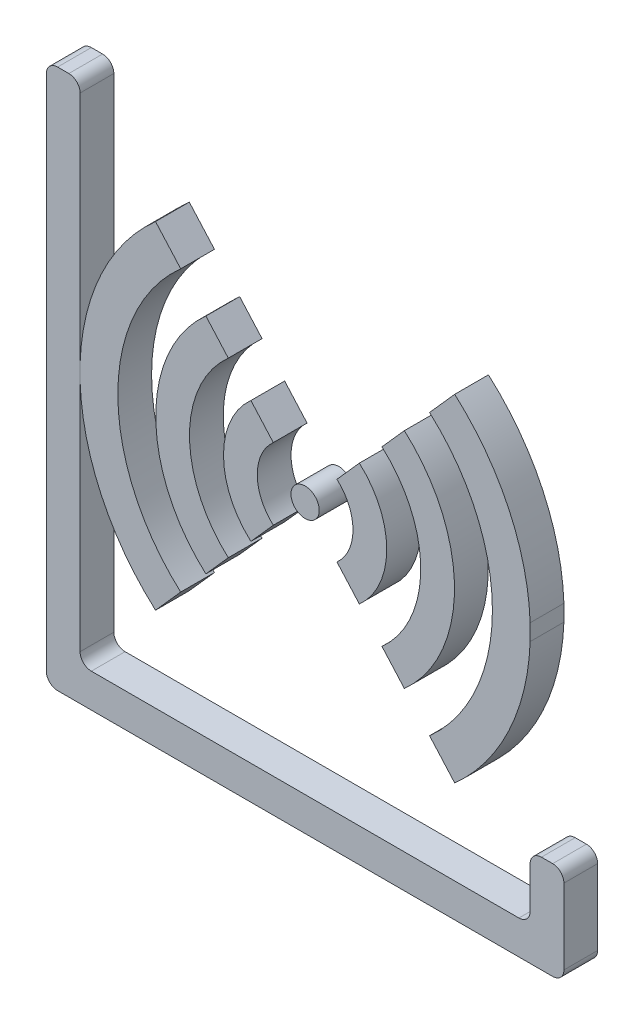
ISO-10303-21;
HEADER;
FILE_DESCRIPTION(('STEP AP214'),'2;1');
FILE_NAME('part.step','',(''),(''),'','','');
FILE_SCHEMA(('AUTOMOTIVE_DESIGN { 1 0 10303 214 1 1 1 1 }'));
ENDSEC;
DATA;
#1=APPLICATION_CONTEXT('core data for automotive mechanical design processes');
#2=APPLICATION_PROTOCOL_DEFINITION('international standard','automotive_design',2000,#1);
#3=PRODUCT_CONTEXT('',#1,'mechanical');
#4=PRODUCT('Part','Part','',(#3));
#5=PRODUCT_RELATED_PRODUCT_CATEGORY('part','',(#4));
#6=PRODUCT_DEFINITION_FORMATION('','',#4);
#7=PRODUCT_DEFINITION_CONTEXT('part definition',#1,'design');
#8=PRODUCT_DEFINITION('design','',#6,#7);
#9=PRODUCT_DEFINITION_SHAPE('','',#8);
#10=(LENGTH_UNIT() NAMED_UNIT(*) SI_UNIT(.MILLI.,.METRE.));
#11=(NAMED_UNIT(*) PLANE_ANGLE_UNIT() SI_UNIT($,.RADIAN.));
#12=(NAMED_UNIT(*) SI_UNIT($,.STERADIAN.) SOLID_ANGLE_UNIT());
#13=UNCERTAINTY_MEASURE_WITH_UNIT(LENGTH_MEASURE(1.E-05),#10,'distance_accuracy_value','');
#14=(GEOMETRIC_REPRESENTATION_CONTEXT(3) GLOBAL_UNCERTAINTY_ASSIGNED_CONTEXT((#13)) GLOBAL_UNIT_ASSIGNED_CONTEXT((#10,
#11,#12)) REPRESENTATION_CONTEXT('',''));
#15=CARTESIAN_POINT('',(0.,0.,0.));
#16=DIRECTION('',(0.,0.,1.));
#17=DIRECTION('',(1.,0.,0.));
#18=AXIS2_PLACEMENT_3D('',#15,#16,#17);
#19=CARTESIAN_POINT('',(0.,0.,3.));
#20=DIRECTION('',(0.,0.,-1.));
#21=DIRECTION('',(-1.,0.,0.));
#22=AXIS2_PLACEMENT_3D('',#19,#20,#21);
#23=CYLINDRICAL_SURFACE('',#22,1.2549880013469);
#24=CARTESIAN_POINT('',(0.,0.,3.));
#25=DIRECTION('',(0.,0.,1.));
#26=DIRECTION('',(1.,0.,0.));
#27=AXIS2_PLACEMENT_3D('',#24,#25,#26);
#28=CIRCLE('',#27,1.2549880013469);
#29=CARTESIAN_POINT('',(1.2549880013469,0.,3.));
#30=VERTEX_POINT('',#29);
#31=EDGE_CURVE('E12',#30,#30,#28,.T.);
#32=ORIENTED_EDGE('',*,*,#31,.F.);
#33=EDGE_LOOP('',(#32));
#34=FACE_BOUND('',#33,.T.);
#35=CARTESIAN_POINT('',(0.,0.,0.));
#36=DIRECTION('',(0.,0.,1.));
#37=DIRECTION('',(1.,0.,0.));
#38=AXIS2_PLACEMENT_3D('',#35,#36,#37);
#39=CIRCLE('',#38,1.2549880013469);
#40=CARTESIAN_POINT('',(1.2549880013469,0.,0.));
#41=VERTEX_POINT('',#40);
#42=EDGE_CURVE('E452',#41,#41,#39,.T.);
#43=ORIENTED_EDGE('',*,*,#42,.T.);
#44=EDGE_LOOP('',(#43));
#45=FACE_BOUND('',#44,.T.);
#46=ADVANCED_FACE('F449',(#34,#45),#23,.T.);
#47=CARTESIAN_POINT('',(0.,0.,3.));
#48=DIRECTION('',(0.,0.,1.));
#49=DIRECTION('',(1.,0.,0.));
#50=AXIS2_PLACEMENT_3D('',#47,#48,#49);
#51=PLANE('',#50);
#52=ORIENTED_EDGE('',*,*,#31,.T.);
#53=EDGE_LOOP('',(#52));
#54=FACE_BOUND('',#53,.T.);
#55=ADVANCED_FACE('F464',(#54),#51,.T.);
#56=CARTESIAN_POINT('',(0.,0.,0.));
#57=DIRECTION('',(0.,0.,1.));
#58=DIRECTION('',(1.,0.,0.));
#59=AXIS2_PLACEMENT_3D('',#56,#57,#58);
#60=PLANE('',#59);
#61=ORIENTED_EDGE('',*,*,#42,.F.);
#62=EDGE_LOOP('',(#61));
#63=FACE_BOUND('',#62,.T.);
#64=ADVANCED_FACE('F462',(#63),#60,.F.);
#65=CLOSED_SHELL('',(#46,#55,#64));
#66=MANIFOLD_SOLID_BREP('B2',#65);
#67=CARTESIAN_POINT('',(0.,0.,3.));
#68=DIRECTION('',(-0.74740931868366,-0.66436383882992,0.));
#69=DIRECTION('',(0.66436383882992,-0.74740931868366,0.));
#70=AXIS2_PLACEMENT_3D('',#67,#68,#69);
#71=PLANE('',#70);
#72=DIRECTION('',(-0.66436383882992,0.74740931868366,0.));
#73=VECTOR('',#72,1.);
#74=CARTESIAN_POINT('',(0.,0.,0.));
#75=LINE('',#74,#73);
#76=CARTESIAN_POINT('',(8.82036787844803,-9.92291386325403,0.));
#77=VERTEX_POINT('',#76);
#78=CARTESIAN_POINT('',(6.82727636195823,-7.68068590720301,0.));
#79=VERTEX_POINT('',#78);
#80=EDGE_CURVE('E563',#77,#79,#75,.T.);
#81=ORIENTED_EDGE('',*,*,#80,.F.);
#82=DIRECTION('',(0.,0.,-1.));
#83=VECTOR('',#82,1.);
#84=CARTESIAN_POINT('',(8.82036787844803,-9.92291386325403,3.));
#85=LINE('',#84,#83);
#86=CARTESIAN_POINT('',(8.82036787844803,-9.92291386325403,3.));
#87=VERTEX_POINT('',#86);
#88=EDGE_CURVE('E447',#87,#77,#85,.T.);
#89=ORIENTED_EDGE('',*,*,#88,.F.);
#90=DIRECTION('',(-0.66436383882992,0.74740931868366,0.));
#91=VECTOR('',#90,1.);
#92=CARTESIAN_POINT('',(0.,0.,3.));
#93=LINE('',#92,#91);
#94=CARTESIAN_POINT('',(6.82727636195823,-7.68068590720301,3.));
#95=VERTEX_POINT('',#94);
#96=EDGE_CURVE('E548',#87,#95,#93,.T.);
#97=ORIENTED_EDGE('',*,*,#96,.T.);
#98=DIRECTION('',(0.,0.,-1.));
#99=VECTOR('',#98,1.);
#100=CARTESIAN_POINT('',(6.82727636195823,-7.68068590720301,3.));
#101=LINE('',#100,#99);
#102=EDGE_CURVE('E516',#95,#79,#101,.T.);
#103=ORIENTED_EDGE('',*,*,#102,.T.);
#104=EDGE_LOOP('',(#81,#89,#97,#103));
#105=FACE_BOUND('',#104,.T.);
#106=ADVANCED_FACE('F500',(#105),#71,.T.);
#107=CARTESIAN_POINT('',(0.,0.,3.));
#108=DIRECTION('',(0.,0.,-1.));
#109=DIRECTION('',(-1.,0.,0.));
#110=AXIS2_PLACEMENT_3D('',#107,#108,#109);
#111=CYLINDRICAL_SURFACE('',#110,13.2764117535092);
#112=CARTESIAN_POINT('',(0.,0.,0.));
#113=DIRECTION('',(0.,0.,1.));
#114=DIRECTION('',(1.,0.,0.));
#115=AXIS2_PLACEMENT_3D('',#112,#113,#114);
#116=CIRCLE('',#115,13.2764117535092);
#117=CARTESIAN_POINT('',(8.82036787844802,9.92291386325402,0.));
#118=VERTEX_POINT('',#117);
#119=EDGE_CURVE('E554',#77,#118,#116,.T.);
#120=ORIENTED_EDGE('',*,*,#119,.T.);
#121=DIRECTION('',(0.,0.,-1.));
#122=VECTOR('',#121,1.);
#123=CARTESIAN_POINT('',(8.82036787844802,9.92291386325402,3.));
#124=LINE('',#123,#122);
#125=CARTESIAN_POINT('',(8.82036787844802,9.92291386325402,3.));
#126=VERTEX_POINT('',#125);
#127=EDGE_CURVE('E508',#126,#118,#124,.T.);
#128=ORIENTED_EDGE('',*,*,#127,.F.);
#129=CARTESIAN_POINT('',(0.,0.,3.));
#130=DIRECTION('',(0.,0.,1.));
#131=DIRECTION('',(1.,0.,0.));
#132=AXIS2_PLACEMENT_3D('',#129,#130,#131);
#133=CIRCLE('',#132,13.2764117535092);
#134=EDGE_CURVE('E542',#87,#126,#133,.T.);
#135=ORIENTED_EDGE('',*,*,#134,.F.);
#136=ORIENTED_EDGE('',*,*,#88,.T.);
#137=EDGE_LOOP('',(#120,#128,#135,#136));
#138=FACE_BOUND('',#137,.T.);
#139=ADVANCED_FACE('F552',(#138),#111,.T.);
#140=CARTESIAN_POINT('',(0.,0.,3.));
#141=DIRECTION('',(0.747409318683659,-0.66436383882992,0.));
#142=DIRECTION('',(0.66436383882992,0.747409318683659,0.));
#143=AXIS2_PLACEMENT_3D('',#140,#141,#142);
#144=PLANE('',#143);
#145=DIRECTION('',(-0.66436383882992,-0.747409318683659,0.));
#146=VECTOR('',#145,1.);
#147=CARTESIAN_POINT('',(0.,0.,0.));
#148=LINE('',#147,#146);
#149=CARTESIAN_POINT('',(6.82727636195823,7.680685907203,0.));
#150=VERTEX_POINT('',#149);
#151=EDGE_CURVE('E566',#118,#150,#148,.T.);
#152=ORIENTED_EDGE('',*,*,#151,.T.);
#153=DIRECTION('',(0.,0.,-1.));
#154=VECTOR('',#153,1.);
#155=CARTESIAN_POINT('',(6.82727636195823,7.680685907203,3.));
#156=LINE('',#155,#154);
#157=CARTESIAN_POINT('',(6.82727636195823,7.680685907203,3.));
#158=VERTEX_POINT('',#157);
#159=EDGE_CURVE('E530',#158,#150,#156,.T.);
#160=ORIENTED_EDGE('',*,*,#159,.F.);
#161=DIRECTION('',(-0.66436383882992,-0.747409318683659,0.));
#162=VECTOR('',#161,1.);
#163=CARTESIAN_POINT('',(0.,0.,3.));
#164=LINE('',#163,#162);
#165=EDGE_CURVE('E547',#126,#158,#164,.T.);
#166=ORIENTED_EDGE('',*,*,#165,.F.);
#167=ORIENTED_EDGE('',*,*,#127,.T.);
#168=EDGE_LOOP('',(#152,#160,#166,#167));
#169=FACE_BOUND('',#168,.T.);
#170=ADVANCED_FACE('F557',(#169),#144,.F.);
#171=CARTESIAN_POINT('',(0.,0.,3.));
#172=DIRECTION('',(0.,0.,-1.));
#173=DIRECTION('',(-1.,0.,0.));
#174=AXIS2_PLACEMENT_3D('',#171,#172,#173);
#175=CYLINDRICAL_SURFACE('',#174,10.2764117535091);
#176=CARTESIAN_POINT('',(0.,0.,0.));
#177=DIRECTION('',(0.,0.,1.));
#178=DIRECTION('',(1.,0.,0.));
#179=AXIS2_PLACEMENT_3D('',#176,#177,#178);
#180=CIRCLE('',#179,10.2764117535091);
#181=EDGE_CURVE('E568',#79,#150,#180,.T.);
#182=ORIENTED_EDGE('',*,*,#181,.F.);
#183=ORIENTED_EDGE('',*,*,#102,.F.);
#184=CARTESIAN_POINT('',(0.,0.,3.));
#185=DIRECTION('',(0.,0.,1.));
#186=DIRECTION('',(1.,0.,0.));
#187=AXIS2_PLACEMENT_3D('',#184,#185,#186);
#188=CIRCLE('',#187,10.2764117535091);
#189=EDGE_CURVE('E558',#95,#158,#188,.T.);
#190=ORIENTED_EDGE('',*,*,#189,.T.);
#191=ORIENTED_EDGE('',*,*,#159,.T.);
#192=EDGE_LOOP('',(#182,#183,#190,#191));
#193=FACE_BOUND('',#192,.T.);
#194=ADVANCED_FACE('F573',(#193),#175,.F.);
#195=CARTESIAN_POINT('',(0.,0.,3.));
#196=DIRECTION('',(0.,0.,1.));
#197=DIRECTION('',(1.,0.,0.));
#198=AXIS2_PLACEMENT_3D('',#195,#196,#197);
#199=PLANE('',#198);
#200=ORIENTED_EDGE('',*,*,#96,.F.);
#201=ORIENTED_EDGE('',*,*,#134,.T.);
#202=ORIENTED_EDGE('',*,*,#165,.T.);
#203=ORIENTED_EDGE('',*,*,#189,.F.);
#204=EDGE_LOOP('',(#200,#201,#202,#203));
#205=FACE_BOUND('',#204,.T.);
#206=ADVANCED_FACE('F544',(#205),#199,.T.);
#207=CARTESIAN_POINT('',(0.,0.,0.));
#208=DIRECTION('',(0.,0.,1.));
#209=DIRECTION('',(1.,0.,0.));
#210=AXIS2_PLACEMENT_3D('',#207,#208,#209);
#211=PLANE('',#210);
#212=ORIENTED_EDGE('',*,*,#80,.T.);
#213=ORIENTED_EDGE('',*,*,#181,.T.);
#214=ORIENTED_EDGE('',*,*,#151,.F.);
#215=ORIENTED_EDGE('',*,*,#119,.F.);
#216=EDGE_LOOP('',(#212,#213,#214,#215));
#217=FACE_BOUND('',#216,.T.);
#218=ADVANCED_FACE('F580',(#217),#211,.F.);
#219=CLOSED_SHELL('',(#106,#139,#170,#194,#206,#218));
#220=MANIFOLD_SOLID_BREP('B7',#219);
#221=CARTESIAN_POINT('',(0.,0.,3.));
#222=DIRECTION('',(0.,0.,-1.));
#223=DIRECTION('',(-1.,0.,0.));
#224=AXIS2_PLACEMENT_3D('',#221,#222,#223);
#225=CYLINDRICAL_SURFACE('',#224,4.2549880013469);
#226=CARTESIAN_POINT('',(0.,0.,0.));
#227=DIRECTION('',(0.,0.,1.));
#228=DIRECTION('',(1.,0.,0.));
#229=AXIS2_PLACEMENT_3D('',#226,#227,#228);
#230=CIRCLE('',#229,4.2549880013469);
#231=CARTESIAN_POINT('',(2.82686016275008,-3.18021768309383,0.));
#232=VERTEX_POINT('',#231);
#233=CARTESIAN_POINT('',(2.82686016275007,3.18021768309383,0.));
#234=VERTEX_POINT('',#233);
#235=EDGE_CURVE('E698',#232,#234,#230,.T.);
#236=ORIENTED_EDGE('',*,*,#235,.F.);
#237=DIRECTION('',(0.,0.,-1.));
#238=VECTOR('',#237,1.);
#239=CARTESIAN_POINT('',(2.82686016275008,-3.18021768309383,3.));
#240=LINE('',#239,#238);
#241=CARTESIAN_POINT('',(2.82686016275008,-3.18021768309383,3.));
#242=VERTEX_POINT('',#241);
#243=EDGE_CURVE('E498',#242,#232,#240,.T.);
#244=ORIENTED_EDGE('',*,*,#243,.F.);
#245=CARTESIAN_POINT('',(0.,0.,3.));
#246=DIRECTION('',(0.,0.,1.));
#247=DIRECTION('',(1.,0.,0.));
#248=AXIS2_PLACEMENT_3D('',#245,#246,#247);
#249=CIRCLE('',#248,4.2549880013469);
#250=CARTESIAN_POINT('',(2.82686016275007,3.18021768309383,3.));
#251=VERTEX_POINT('',#250);
#252=EDGE_CURVE('E692',#242,#251,#249,.T.);
#253=ORIENTED_EDGE('',*,*,#252,.T.);
#254=DIRECTION('',(0.,0.,-1.));
#255=VECTOR('',#254,1.);
#256=CARTESIAN_POINT('',(2.82686016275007,3.18021768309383,3.));
#257=LINE('',#256,#255);
#258=EDGE_CURVE('E650',#251,#234,#257,.T.);
#259=ORIENTED_EDGE('',*,*,#258,.T.);
#260=EDGE_LOOP('',(#236,#244,#253,#259));
#261=FACE_BOUND('',#260,.T.);
#262=ADVANCED_FACE('F634',(#261),#225,.F.);
#263=CARTESIAN_POINT('',(0.,0.,3.));
#264=DIRECTION('',(-0.74740931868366,-0.66436383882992,0.));
#265=DIRECTION('',(0.66436383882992,-0.74740931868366,0.));
#266=AXIS2_PLACEMENT_3D('',#263,#264,#265);
#267=PLANE('',#266);
#268=DIRECTION('',(-0.66436383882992,0.74740931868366,0.));
#269=VECTOR('',#268,1.);
#270=CARTESIAN_POINT('',(0.,0.,0.));
#271=LINE('',#270,#269);
#272=CARTESIAN_POINT('',(4.81995167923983,-5.42244563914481,0.));
#273=VERTEX_POINT('',#272);
#274=EDGE_CURVE('E682',#273,#232,#271,.T.);
#275=ORIENTED_EDGE('',*,*,#274,.F.);
#276=DIRECTION('',(0.,0.,-1.));
#277=VECTOR('',#276,1.);
#278=CARTESIAN_POINT('',(4.81995167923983,-5.42244563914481,3.));
#279=LINE('',#278,#277);
#280=CARTESIAN_POINT('',(4.81995167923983,-5.42244563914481,3.));
#281=VERTEX_POINT('',#280);
#282=EDGE_CURVE('E642',#281,#273,#279,.T.);
#283=ORIENTED_EDGE('',*,*,#282,.F.);
#284=DIRECTION('',(-0.66436383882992,0.74740931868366,0.));
#285=VECTOR('',#284,1.);
#286=CARTESIAN_POINT('',(0.,0.,3.));
#287=LINE('',#286,#285);
#288=EDGE_CURVE('E680',#281,#242,#287,.T.);
#289=ORIENTED_EDGE('',*,*,#288,.T.);
#290=ORIENTED_EDGE('',*,*,#243,.T.);
#291=EDGE_LOOP('',(#275,#283,#289,#290));
#292=FACE_BOUND('',#291,.T.);
#293=ADVANCED_FACE('F678',(#292),#267,.T.);
#294=CARTESIAN_POINT('',(0.,0.,3.));
#295=DIRECTION('',(0.,0.,-1.));
#296=DIRECTION('',(-1.,0.,0.));
#297=AXIS2_PLACEMENT_3D('',#294,#295,#296);
#298=CYLINDRICAL_SURFACE('',#297,7.2549880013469);
#299=CARTESIAN_POINT('',(0.,0.,0.));
#300=DIRECTION('',(0.,0.,1.));
#301=DIRECTION('',(1.,0.,0.));
#302=AXIS2_PLACEMENT_3D('',#299,#300,#301);
#303=CIRCLE('',#302,7.2549880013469);
#304=CARTESIAN_POINT('',(4.81995167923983,5.42244563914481,0.));
#305=VERTEX_POINT('',#304);
#306=EDGE_CURVE('E701',#273,#305,#303,.T.);
#307=ORIENTED_EDGE('',*,*,#306,.T.);
#308=DIRECTION('',(0.,0.,-1.));
#309=VECTOR('',#308,1.);
#310=CARTESIAN_POINT('',(4.81995167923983,5.42244563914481,3.));
#311=LINE('',#310,#309);
#312=CARTESIAN_POINT('',(4.81995167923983,5.42244563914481,3.));
#313=VERTEX_POINT('',#312);
#314=EDGE_CURVE('E664',#313,#305,#311,.T.);
#315=ORIENTED_EDGE('',*,*,#314,.F.);
#316=CARTESIAN_POINT('',(0.,0.,3.));
#317=DIRECTION('',(0.,0.,1.));
#318=DIRECTION('',(1.,0.,0.));
#319=AXIS2_PLACEMENT_3D('',#316,#317,#318);
#320=CIRCLE('',#319,7.2549880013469);
#321=EDGE_CURVE('E685',#281,#313,#320,.T.);
#322=ORIENTED_EDGE('',*,*,#321,.F.);
#323=ORIENTED_EDGE('',*,*,#282,.T.);
#324=EDGE_LOOP('',(#307,#315,#322,#323));
#325=FACE_BOUND('',#324,.T.);
#326=ADVANCED_FACE('F686',(#325),#298,.T.);
#327=CARTESIAN_POINT('',(0.,0.,3.));
#328=DIRECTION('',(-0.74740931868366,0.66436383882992,0.));
#329=DIRECTION('',(-0.66436383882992,-0.74740931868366,0.));
#330=AXIS2_PLACEMENT_3D('',#327,#328,#329);
#331=PLANE('',#330);
#332=DIRECTION('',(0.66436383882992,0.74740931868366,0.));
#333=VECTOR('',#332,1.);
#334=CARTESIAN_POINT('',(0.,0.,0.));
#335=LINE('',#334,#333);
#336=EDGE_CURVE('E694',#234,#305,#335,.T.);
#337=ORIENTED_EDGE('',*,*,#336,.F.);
#338=ORIENTED_EDGE('',*,*,#258,.F.);
#339=DIRECTION('',(0.66436383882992,0.74740931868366,0.));
#340=VECTOR('',#339,1.);
#341=CARTESIAN_POINT('',(0.,0.,3.));
#342=LINE('',#341,#340);
#343=EDGE_CURVE('E689',#251,#313,#342,.T.);
#344=ORIENTED_EDGE('',*,*,#343,.T.);
#345=ORIENTED_EDGE('',*,*,#314,.T.);
#346=EDGE_LOOP('',(#337,#338,#344,#345));
#347=FACE_BOUND('',#346,.T.);
#348=ADVANCED_FACE('F708',(#347),#331,.T.);
#349=CARTESIAN_POINT('',(0.,0.,3.));
#350=DIRECTION('',(0.,0.,1.));
#351=DIRECTION('',(1.,0.,0.));
#352=AXIS2_PLACEMENT_3D('',#349,#350,#351);
#353=PLANE('',#352);
#354=ORIENTED_EDGE('',*,*,#252,.F.);
#355=ORIENTED_EDGE('',*,*,#288,.F.);
#356=ORIENTED_EDGE('',*,*,#321,.T.);
#357=ORIENTED_EDGE('',*,*,#343,.F.);
#358=EDGE_LOOP('',(#354,#355,#356,#357));
#359=FACE_BOUND('',#358,.T.);
#360=ADVANCED_FACE('F691',(#359),#353,.T.);
#361=CARTESIAN_POINT('',(0.,0.,0.));
#362=DIRECTION('',(0.,0.,1.));
#363=DIRECTION('',(1.,0.,0.));
#364=AXIS2_PLACEMENT_3D('',#361,#362,#363);
#365=PLANE('',#364);
#366=ORIENTED_EDGE('',*,*,#235,.T.);
#367=ORIENTED_EDGE('',*,*,#336,.T.);
#368=ORIENTED_EDGE('',*,*,#306,.F.);
#369=ORIENTED_EDGE('',*,*,#274,.T.);
#370=EDGE_LOOP('',(#366,#367,#368,#369));
#371=FACE_BOUND('',#370,.T.);
#372=ADVANCED_FACE('F707',(#371),#365,.F.);
#373=CLOSED_SHELL('',(#262,#293,#326,#348,#360,#372));
#374=MANIFOLD_SOLID_BREP('B441',#373);
#375=CARTESIAN_POINT('',(0.,0.,3.));
#376=DIRECTION('',(0.,0.,-1.));
#377=DIRECTION('',(-1.,0.,0.));
#378=AXIS2_PLACEMENT_3D('',#375,#376,#377);
#379=CYLINDRICAL_SURFACE('',#378,4.2549880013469);
#380=CARTESIAN_POINT('',(0.,0.,0.));
#381=DIRECTION('',(0.,0.,1.));
#382=DIRECTION('',(1.,0.,0.));
#383=AXIS2_PLACEMENT_3D('',#380,#381,#382);
#384=CIRCLE('',#383,4.2549880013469);
#385=CARTESIAN_POINT('',(-2.82686016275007,3.18021768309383,0.));
#386=VERTEX_POINT('',#385);
#387=CARTESIAN_POINT('',(-2.82686016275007,-3.18021768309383,0.));
#388=VERTEX_POINT('',#387);
#389=EDGE_CURVE('E831',#386,#388,#384,.T.);
#390=ORIENTED_EDGE('',*,*,#389,.F.);
#391=DIRECTION('',(0.,0.,-1.));
#392=VECTOR('',#391,1.);
#393=CARTESIAN_POINT('',(-2.82686016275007,3.18021768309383,3.));
#394=LINE('',#393,#392);
#395=CARTESIAN_POINT('',(-2.82686016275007,3.18021768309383,3.));
#396=VERTEX_POINT('',#395);
#397=EDGE_CURVE('E632',#396,#386,#394,.T.);
#398=ORIENTED_EDGE('',*,*,#397,.F.);
#399=CARTESIAN_POINT('',(0.,0.,3.));
#400=DIRECTION('',(0.,0.,1.));
#401=DIRECTION('',(1.,0.,0.));
#402=AXIS2_PLACEMENT_3D('',#399,#400,#401);
#403=CIRCLE('',#402,4.2549880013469);
#404=CARTESIAN_POINT('',(-2.82686016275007,-3.18021768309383,3.));
#405=VERTEX_POINT('',#404);
#406=EDGE_CURVE('E816',#396,#405,#403,.T.);
#407=ORIENTED_EDGE('',*,*,#406,.T.);
#408=DIRECTION('',(0.,0.,-1.));
#409=VECTOR('',#408,1.);
#410=CARTESIAN_POINT('',(-2.82686016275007,-3.18021768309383,3.));
#411=LINE('',#410,#409);
#412=EDGE_CURVE('E784',#405,#388,#411,.T.);
#413=ORIENTED_EDGE('',*,*,#412,.T.);
#414=EDGE_LOOP('',(#390,#398,#407,#413));
#415=FACE_BOUND('',#414,.T.);
#416=ADVANCED_FACE('F768',(#415),#379,.F.);
#417=CARTESIAN_POINT('',(0.,0.,3.));
#418=DIRECTION('',(-0.74740931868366,-0.66436383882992,0.));
#419=DIRECTION('',(0.66436383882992,-0.74740931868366,0.));
#420=AXIS2_PLACEMENT_3D('',#417,#418,#419);
#421=PLANE('',#420);
#422=DIRECTION('',(-0.66436383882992,0.74740931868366,0.));
#423=VECTOR('',#422,1.);
#424=CARTESIAN_POINT('',(0.,0.,0.));
#425=LINE('',#424,#423);
#426=CARTESIAN_POINT('',(-4.81995167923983,5.42244563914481,0.));
#427=VERTEX_POINT('',#426);
#428=EDGE_CURVE('E822',#386,#427,#425,.T.);
#429=ORIENTED_EDGE('',*,*,#428,.T.);
#430=DIRECTION('',(0.,0.,-1.));
#431=VECTOR('',#430,1.);
#432=CARTESIAN_POINT('',(-4.81995167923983,5.42244563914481,3.));
#433=LINE('',#432,#431);
#434=CARTESIAN_POINT('',(-4.81995167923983,5.42244563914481,3.));
#435=VERTEX_POINT('',#434);
#436=EDGE_CURVE('E776',#435,#427,#433,.T.);
#437=ORIENTED_EDGE('',*,*,#436,.F.);
#438=DIRECTION('',(-0.66436383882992,0.74740931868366,0.));
#439=VECTOR('',#438,1.);
#440=CARTESIAN_POINT('',(0.,0.,3.));
#441=LINE('',#440,#439);
#442=EDGE_CURVE('E810',#396,#435,#441,.T.);
#443=ORIENTED_EDGE('',*,*,#442,.F.);
#444=ORIENTED_EDGE('',*,*,#397,.T.);
#445=EDGE_LOOP('',(#429,#437,#443,#444));
#446=FACE_BOUND('',#445,.T.);
#447=ADVANCED_FACE('F820',(#446),#421,.F.);
#448=CARTESIAN_POINT('',(0.,0.,3.));
#449=DIRECTION('',(0.,0.,-1.));
#450=DIRECTION('',(-1.,0.,0.));
#451=AXIS2_PLACEMENT_3D('',#448,#449,#450);
#452=CYLINDRICAL_SURFACE('',#451,7.2549880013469);
#453=CARTESIAN_POINT('',(0.,0.,0.));
#454=DIRECTION('',(0.,0.,1.));
#455=DIRECTION('',(1.,0.,0.));
#456=AXIS2_PLACEMENT_3D('',#453,#454,#455);
#457=CIRCLE('',#456,7.2549880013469);
#458=CARTESIAN_POINT('',(-4.81995167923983,-5.42244563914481,0.));
#459=VERTEX_POINT('',#458);
#460=EDGE_CURVE('E834',#427,#459,#457,.T.);
#461=ORIENTED_EDGE('',*,*,#460,.T.);
#462=DIRECTION('',(0.,0.,-1.));
#463=VECTOR('',#462,1.);
#464=CARTESIAN_POINT('',(-4.81995167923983,-5.42244563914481,3.));
#465=LINE('',#464,#463);
#466=CARTESIAN_POINT('',(-4.81995167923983,-5.42244563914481,3.));
#467=VERTEX_POINT('',#466);
#468=EDGE_CURVE('E798',#467,#459,#465,.T.);
#469=ORIENTED_EDGE('',*,*,#468,.F.);
#470=CARTESIAN_POINT('',(0.,0.,3.));
#471=DIRECTION('',(0.,0.,1.));
#472=DIRECTION('',(1.,0.,0.));
#473=AXIS2_PLACEMENT_3D('',#470,#471,#472);
#474=CIRCLE('',#473,7.2549880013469);
#475=EDGE_CURVE('E815',#435,#467,#474,.T.);
#476=ORIENTED_EDGE('',*,*,#475,.F.);
#477=ORIENTED_EDGE('',*,*,#436,.T.);
#478=EDGE_LOOP('',(#461,#469,#476,#477));
#479=FACE_BOUND('',#478,.T.);
#480=ADVANCED_FACE('F825',(#479),#452,.T.);
#481=CARTESIAN_POINT('',(0.,0.,3.));
#482=DIRECTION('',(0.74740931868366,-0.66436383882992,0.));
#483=DIRECTION('',(0.66436383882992,0.74740931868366,0.));
#484=AXIS2_PLACEMENT_3D('',#481,#482,#483);
#485=PLANE('',#484);
#486=DIRECTION('',(-0.66436383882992,-0.74740931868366,0.));
#487=VECTOR('',#486,1.);
#488=CARTESIAN_POINT('',(0.,0.,0.));
#489=LINE('',#488,#487);
#490=EDGE_CURVE('E836',#388,#459,#489,.T.);
#491=ORIENTED_EDGE('',*,*,#490,.F.);
#492=ORIENTED_EDGE('',*,*,#412,.F.);
#493=DIRECTION('',(-0.66436383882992,-0.74740931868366,0.));
#494=VECTOR('',#493,1.);
#495=CARTESIAN_POINT('',(0.,0.,3.));
#496=LINE('',#495,#494);
#497=EDGE_CURVE('E826',#405,#467,#496,.T.);
#498=ORIENTED_EDGE('',*,*,#497,.T.);
#499=ORIENTED_EDGE('',*,*,#468,.T.);
#500=EDGE_LOOP('',(#491,#492,#498,#499));
#501=FACE_BOUND('',#500,.T.);
#502=ADVANCED_FACE('F841',(#501),#485,.T.);
#503=CARTESIAN_POINT('',(0.,0.,3.));
#504=DIRECTION('',(0.,0.,1.));
#505=DIRECTION('',(1.,0.,0.));
#506=AXIS2_PLACEMENT_3D('',#503,#504,#505);
#507=PLANE('',#506);
#508=ORIENTED_EDGE('',*,*,#406,.F.);
#509=ORIENTED_EDGE('',*,*,#442,.T.);
#510=ORIENTED_EDGE('',*,*,#475,.T.);
#511=ORIENTED_EDGE('',*,*,#497,.F.);
#512=EDGE_LOOP('',(#508,#509,#510,#511));
#513=FACE_BOUND('',#512,.T.);
#514=ADVANCED_FACE('F812',(#513),#507,.T.);
#515=CARTESIAN_POINT('',(0.,0.,0.));
#516=DIRECTION('',(0.,0.,1.));
#517=DIRECTION('',(1.,0.,0.));
#518=AXIS2_PLACEMENT_3D('',#515,#516,#517);
#519=PLANE('',#518);
#520=ORIENTED_EDGE('',*,*,#389,.T.);
#521=ORIENTED_EDGE('',*,*,#490,.T.);
#522=ORIENTED_EDGE('',*,*,#460,.F.);
#523=ORIENTED_EDGE('',*,*,#428,.F.);
#524=EDGE_LOOP('',(#520,#521,#522,#523));
#525=FACE_BOUND('',#524,.T.);
#526=ADVANCED_FACE('F848',(#525),#519,.F.);
#527=CLOSED_SHELL('',(#416,#447,#480,#502,#514,#526));
#528=MANIFOLD_SOLID_BREP('B492',#527);
#529=CARTESIAN_POINT('',(0.,0.,3.));
#530=DIRECTION('',(0.,0.,-1.));
#531=DIRECTION('',(-1.,0.,0.));
#532=AXIS2_PLACEMENT_3D('',#529,#530,#531);
#533=CYLINDRICAL_SURFACE('',#532,10.2764117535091);
#534=CARTESIAN_POINT('',(0.,0.,0.));
#535=DIRECTION('',(0.,0.,1.));
#536=DIRECTION('',(1.,0.,0.));
#537=AXIS2_PLACEMENT_3D('',#534,#535,#536);
#538=CIRCLE('',#537,10.2764117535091);
#539=CARTESIAN_POINT('',(-6.82727636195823,7.680685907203,0.));
#540=VERTEX_POINT('',#539);
#541=CARTESIAN_POINT('',(-6.82727636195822,-7.680685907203,0.));
#542=VERTEX_POINT('',#541);
#543=EDGE_CURVE('E965',#540,#542,#538,.T.);
#544=ORIENTED_EDGE('',*,*,#543,.F.);
#545=DIRECTION('',(0.,0.,-1.));
#546=VECTOR('',#545,1.);
#547=CARTESIAN_POINT('',(-6.82727636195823,7.680685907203,3.));
#548=LINE('',#547,#546);
#549=CARTESIAN_POINT('',(-6.82727636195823,7.680685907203,3.));
#550=VERTEX_POINT('',#549);
#551=EDGE_CURVE('E766',#550,#540,#548,.T.);
#552=ORIENTED_EDGE('',*,*,#551,.F.);
#553=CARTESIAN_POINT('',(0.,0.,3.));
#554=DIRECTION('',(0.,0.,1.));
#555=DIRECTION('',(1.,0.,0.));
#556=AXIS2_PLACEMENT_3D('',#553,#554,#555);
#557=CIRCLE('',#556,10.2764117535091);
#558=CARTESIAN_POINT('',(-6.82727636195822,-7.680685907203,3.));
#559=VERTEX_POINT('',#558);
#560=EDGE_CURVE('E959',#550,#559,#557,.T.);
#561=ORIENTED_EDGE('',*,*,#560,.T.);
#562=DIRECTION('',(0.,0.,-1.));
#563=VECTOR('',#562,1.);
#564=CARTESIAN_POINT('',(-6.82727636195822,-7.680685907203,3.));
#565=LINE('',#564,#563);
#566=EDGE_CURVE('E940',#559,#542,#565,.T.);
#567=ORIENTED_EDGE('',*,*,#566,.T.);
#568=EDGE_LOOP('',(#544,#552,#561,#567));
#569=FACE_BOUND('',#568,.T.);
#570=ADVANCED_FACE('F902',(#569),#533,.F.);
#571=CARTESIAN_POINT('',(0.,0.,3.));
#572=DIRECTION('',(0.74740931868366,0.66436383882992,0.));
#573=DIRECTION('',(-0.66436383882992,0.74740931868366,0.));
#574=AXIS2_PLACEMENT_3D('',#571,#572,#573);
#575=PLANE('',#574);
#576=DIRECTION('',(0.66436383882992,-0.74740931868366,0.));
#577=VECTOR('',#576,1.);
#578=CARTESIAN_POINT('',(0.,0.,0.));
#579=LINE('',#578,#577);
#580=CARTESIAN_POINT('',(-8.82036787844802,9.92291386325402,0.));
#581=VERTEX_POINT('',#580);
#582=EDGE_CURVE('E953',#581,#540,#579,.T.);
#583=ORIENTED_EDGE('',*,*,#582,.F.);
#584=DIRECTION('',(0.,0.,-1.));
#585=VECTOR('',#584,1.);
#586=CARTESIAN_POINT('',(-8.82036787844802,9.92291386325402,3.));
#587=LINE('',#586,#585);
#588=CARTESIAN_POINT('',(-8.82036787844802,9.92291386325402,3.));
#589=VERTEX_POINT('',#588);
#590=EDGE_CURVE('E910',#589,#581,#587,.T.);
#591=ORIENTED_EDGE('',*,*,#590,.F.);
#592=DIRECTION('',(0.66436383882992,-0.74740931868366,0.));
#593=VECTOR('',#592,1.);
#594=CARTESIAN_POINT('',(0.,0.,3.));
#595=LINE('',#594,#593);
#596=EDGE_CURVE('E951',#589,#550,#595,.T.);
#597=ORIENTED_EDGE('',*,*,#596,.T.);
#598=ORIENTED_EDGE('',*,*,#551,.T.);
#599=EDGE_LOOP('',(#583,#591,#597,#598));
#600=FACE_BOUND('',#599,.T.);
#601=ADVANCED_FACE('F949',(#600),#575,.T.);
#602=CARTESIAN_POINT('',(0.,0.,3.));
#603=DIRECTION('',(0.,0.,-1.));
#604=DIRECTION('',(-1.,0.,0.));
#605=AXIS2_PLACEMENT_3D('',#602,#603,#604);
#606=CYLINDRICAL_SURFACE('',#605,13.2764117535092);
#607=CARTESIAN_POINT('',(0.,0.,0.));
#608=DIRECTION('',(0.,0.,1.));
#609=DIRECTION('',(1.,0.,0.));
#610=AXIS2_PLACEMENT_3D('',#607,#608,#609);
#611=CIRCLE('',#610,13.2764117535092);
#612=CARTESIAN_POINT('',(-8.82036787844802,-9.92291386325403,0.));
#613=VERTEX_POINT('',#612);
#614=EDGE_CURVE('E933',#581,#613,#611,.T.);
#615=ORIENTED_EDGE('',*,*,#614,.T.);
#616=DIRECTION('',(0.,0.,-1.));
#617=VECTOR('',#616,1.);
#618=CARTESIAN_POINT('',(-8.82036787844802,-9.92291386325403,3.));
#619=LINE('',#618,#617);
#620=CARTESIAN_POINT('',(-8.82036787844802,-9.92291386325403,3.));
#621=VERTEX_POINT('',#620);
#622=EDGE_CURVE('E954',#621,#613,#619,.T.);
#623=ORIENTED_EDGE('',*,*,#622,.F.);
#624=CARTESIAN_POINT('',(0.,0.,3.));
#625=DIRECTION('',(0.,0.,1.));
#626=DIRECTION('',(1.,0.,0.));
#627=AXIS2_PLACEMENT_3D('',#624,#625,#626);
#628=CIRCLE('',#627,13.2764117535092);
#629=EDGE_CURVE('E955',#589,#621,#628,.T.);
#630=ORIENTED_EDGE('',*,*,#629,.F.);
#631=ORIENTED_EDGE('',*,*,#590,.T.);
#632=EDGE_LOOP('',(#615,#623,#630,#631));
#633=FACE_BOUND('',#632,.T.);
#634=ADVANCED_FACE('F956',(#633),#606,.T.);
#635=CARTESIAN_POINT('',(0.,0.,3.));
#636=DIRECTION('',(-0.74740931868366,0.66436383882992,0.));
#637=DIRECTION('',(-0.66436383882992,-0.74740931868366,0.));
#638=AXIS2_PLACEMENT_3D('',#635,#636,#637);
#639=PLANE('',#638);
#640=DIRECTION('',(0.66436383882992,0.74740931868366,0.));
#641=VECTOR('',#640,1.);
#642=CARTESIAN_POINT('',(0.,0.,0.));
#643=LINE('',#642,#641);
#644=EDGE_CURVE('E961',#613,#542,#643,.T.);
#645=ORIENTED_EDGE('',*,*,#644,.T.);
#646=ORIENTED_EDGE('',*,*,#566,.F.);
#647=DIRECTION('',(0.66436383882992,0.74740931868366,0.));
#648=VECTOR('',#647,1.);
#649=CARTESIAN_POINT('',(0.,0.,3.));
#650=LINE('',#649,#648);
#651=EDGE_CURVE('E918',#621,#559,#650,.T.);
#652=ORIENTED_EDGE('',*,*,#651,.F.);
#653=ORIENTED_EDGE('',*,*,#622,.T.);
#654=EDGE_LOOP('',(#645,#646,#652,#653));
#655=FACE_BOUND('',#654,.T.);
#656=ADVANCED_FACE('F974',(#655),#639,.F.);
#657=CARTESIAN_POINT('',(0.,0.,3.));
#658=DIRECTION('',(0.,0.,1.));
#659=DIRECTION('',(1.,0.,0.));
#660=AXIS2_PLACEMENT_3D('',#657,#658,#659);
#661=PLANE('',#660);
#662=ORIENTED_EDGE('',*,*,#560,.F.);
#663=ORIENTED_EDGE('',*,*,#596,.F.);
#664=ORIENTED_EDGE('',*,*,#629,.T.);
#665=ORIENTED_EDGE('',*,*,#651,.T.);
#666=EDGE_LOOP('',(#662,#663,#664,#665));
#667=FACE_BOUND('',#666,.T.);
#668=ADVANCED_FACE('F958',(#667),#661,.T.);
#669=CARTESIAN_POINT('',(0.,0.,0.));
#670=DIRECTION('',(0.,0.,1.));
#671=DIRECTION('',(1.,0.,0.));
#672=AXIS2_PLACEMENT_3D('',#669,#670,#671);
#673=PLANE('',#672);
#674=ORIENTED_EDGE('',*,*,#543,.T.);
#675=ORIENTED_EDGE('',*,*,#644,.F.);
#676=ORIENTED_EDGE('',*,*,#614,.F.);
#677=ORIENTED_EDGE('',*,*,#582,.T.);
#678=EDGE_LOOP('',(#674,#675,#676,#677));
#679=FACE_BOUND('',#678,.T.);
#680=ADVANCED_FACE('F976',(#679),#673,.F.);
#681=CLOSED_SHELL('',(#570,#601,#634,#656,#668,#680));
#682=MANIFOLD_SOLID_BREP('B626',#681);
#683=CARTESIAN_POINT('',(0.,0.,3.));
#684=DIRECTION('',(0.,0.,-1.));
#685=DIRECTION('',(-1.,0.,0.));
#686=AXIS2_PLACEMENT_3D('',#683,#684,#685);
#687=CYLINDRICAL_SURFACE('',#686,16.6447609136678);
#688=CARTESIAN_POINT('',(0.,0.,0.));
#689=DIRECTION('',(0.,0.,1.));
#690=DIRECTION('',(1.,0.,0.));
#691=AXIS2_PLACEMENT_3D('',#688,#689,#690);
#692=CIRCLE('',#691,16.6447609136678);
#693=CARTESIAN_POINT('',(-11.0581772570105,12.4404494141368,0.));
#694=VERTEX_POINT('',#693);
#695=CARTESIAN_POINT('',(-11.0581772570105,-12.4404494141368,0.));
#696=VERTEX_POINT('',#695);
#697=EDGE_CURVE('E1141',#694,#696,#692,.T.);
#698=ORIENTED_EDGE('',*,*,#697,.F.);
#699=DIRECTION('',(0.,0.,-1.));
#700=VECTOR('',#699,1.);
#701=CARTESIAN_POINT('',(-11.0581772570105,12.4404494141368,3.));
#702=LINE('',#701,#700);
#703=CARTESIAN_POINT('',(-11.0581772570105,12.4404494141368,3.));
#704=VERTEX_POINT('',#703);
#705=EDGE_CURVE('E900',#704,#694,#702,.T.);
#706=ORIENTED_EDGE('',*,*,#705,.F.);
#707=CARTESIAN_POINT('',(0.,0.,3.));
#708=DIRECTION('',(0.,0.,1.));
#709=DIRECTION('',(1.,0.,0.));
#710=AXIS2_PLACEMENT_3D('',#707,#708,#709);
#711=CIRCLE('',#710,16.6447609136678);
#712=CARTESIAN_POINT('',(-11.0581772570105,-12.4404494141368,3.));
#713=VERTEX_POINT('',#712);
#714=EDGE_CURVE('E1118',#704,#713,#711,.T.);
#715=ORIENTED_EDGE('',*,*,#714,.T.);
#716=DIRECTION('',(0.,0.,-1.));
#717=VECTOR('',#716,1.);
#718=CARTESIAN_POINT('',(-11.0581772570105,-12.4404494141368,3.));
#719=LINE('',#718,#717);
#720=EDGE_CURVE('E1081',#713,#696,#719,.T.);
#721=ORIENTED_EDGE('',*,*,#720,.T.);
#722=EDGE_LOOP('',(#698,#706,#715,#721));
#723=FACE_BOUND('',#722,.T.);
#724=ADVANCED_FACE('F1036',(#723),#687,.F.);
#725=CARTESIAN_POINT('',(0.,0.,3.));
#726=DIRECTION('',(0.747409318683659,0.66436383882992,0.));
#727=DIRECTION('',(-0.66436383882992,0.747409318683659,0.));
#728=AXIS2_PLACEMENT_3D('',#725,#726,#727);
#729=PLANE('',#728);
#730=DIRECTION('',(0.66436383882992,-0.747409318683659,0.));
#731=VECTOR('',#730,1.);
#732=CARTESIAN_POINT('',(0.,0.,0.));
#733=LINE('',#732,#731);
#734=CARTESIAN_POINT('',(-13.295986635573,14.9579849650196,0.));
#735=VERTEX_POINT('',#734);
#736=EDGE_CURVE('E1139',#735,#694,#733,.T.);
#737=ORIENTED_EDGE('',*,*,#736,.F.);
#738=DIRECTION('',(0.,0.,-1.));
#739=VECTOR('',#738,1.);
#740=CARTESIAN_POINT('',(-13.295986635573,14.9579849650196,3.));
#741=LINE('',#740,#739);
#742=CARTESIAN_POINT('',(-13.295986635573,14.9579849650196,3.));
#743=VERTEX_POINT('',#742);
#744=EDGE_CURVE('E1044',#743,#735,#741,.T.);
#745=ORIENTED_EDGE('',*,*,#744,.F.);
#746=DIRECTION('',(0.66436383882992,-0.747409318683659,0.));
#747=VECTOR('',#746,1.);
#748=CARTESIAN_POINT('',(0.,0.,3.));
#749=LINE('',#748,#747);
#750=EDGE_CURVE('E1116',#743,#704,#749,.T.);
#751=ORIENTED_EDGE('',*,*,#750,.T.);
#752=ORIENTED_EDGE('',*,*,#705,.T.);
#753=EDGE_LOOP('',(#737,#745,#751,#752));
#754=FACE_BOUND('',#753,.T.);
#755=ADVANCED_FACE('F1140',(#754),#729,.T.);
#756=CARTESIAN_POINT('',(0.,0.,3.));
#757=DIRECTION('',(0.,0.,-1.));
#758=DIRECTION('',(-1.,0.,0.));
#759=AXIS2_PLACEMENT_3D('',#756,#757,#758);
#760=CYLINDRICAL_SURFACE('',#759,20.0131100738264);
#761=CARTESIAN_POINT('',(0.,0.,0.));
#762=DIRECTION('',(0.,0.,1.));
#763=DIRECTION('',(1.,0.,0.));
#764=AXIS2_PLACEMENT_3D('',#761,#762,#763);
#765=CIRCLE('',#764,20.0131100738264);
#766=CARTESIAN_POINT('',(-20.,0.724275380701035,0.));
#767=VERTEX_POINT('',#766);
#768=EDGE_CURVE('E1127',#735,#767,#765,.T.);
#769=ORIENTED_EDGE('',*,*,#768,.T.);
#770=DIRECTION('',(0.,0.,-1.));
#771=VECTOR('',#770,1.);
#772=CARTESIAN_POINT('',(-20.,0.724275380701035,3.));
#773=LINE('',#772,#771);
#774=CARTESIAN_POINT('',(-20.,0.724275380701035,3.));
#775=VERTEX_POINT('',#774);
#776=EDGE_CURVE('E1109',#775,#767,#773,.T.);
#777=ORIENTED_EDGE('',*,*,#776,.F.);
#778=CARTESIAN_POINT('',(0.,0.,3.));
#779=DIRECTION('',(0.,0.,1.));
#780=DIRECTION('',(1.,0.,0.));
#781=AXIS2_PLACEMENT_3D('',#778,#779,#780);
#782=CIRCLE('',#781,20.0131100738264);
#783=EDGE_CURVE('E1100',#743,#775,#782,.T.);
#784=ORIENTED_EDGE('',*,*,#783,.F.);
#785=ORIENTED_EDGE('',*,*,#744,.T.);
#786=EDGE_LOOP('',(#769,#777,#784,#785));
#787=FACE_BOUND('',#786,.T.);
#788=ADVANCED_FACE('F1134',(#787),#760,.T.);
#789=CARTESIAN_POINT('',(-20.,0.,3.));
#790=DIRECTION('',(1.,0.,0.));
#791=DIRECTION('',(0.,1.,0.));
#792=AXIS2_PLACEMENT_3D('',#789,#790,#791);
#793=PLANE('',#792);
#794=DIRECTION('',(0.,-1.,0.));
#795=VECTOR('',#794,1.);
#796=CARTESIAN_POINT('',(-20.,0.,0.));
#797=LINE('',#796,#795);
#798=CARTESIAN_POINT('',(-20.,-0.724275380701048,0.));
#799=VERTEX_POINT('',#798);
#800=EDGE_CURVE('E1108',#767,#799,#797,.T.);
#801=ORIENTED_EDGE('',*,*,#800,.T.);
#802=DIRECTION('',(0.,0.,-1.));
#803=VECTOR('',#802,1.);
#804=CARTESIAN_POINT('',(-20.,-0.724275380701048,3.));
#805=LINE('',#804,#803);
#806=CARTESIAN_POINT('',(-20.,-0.724275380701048,3.));
#807=VERTEX_POINT('',#806);
#808=EDGE_CURVE('E1105',#807,#799,#805,.T.);
#809=ORIENTED_EDGE('',*,*,#808,.F.);
#810=DIRECTION('',(0.,-1.,0.));
#811=VECTOR('',#810,1.);
#812=CARTESIAN_POINT('',(-20.,0.,3.));
#813=LINE('',#812,#811);
#814=EDGE_CURVE('E1093',#775,#807,#813,.T.);
#815=ORIENTED_EDGE('',*,*,#814,.F.);
#816=ORIENTED_EDGE('',*,*,#776,.T.);
#817=EDGE_LOOP('',(#801,#809,#815,#816));
#818=FACE_BOUND('',#817,.T.);
#819=ADVANCED_FACE('F1106',(#818),#793,.F.);
#820=CARTESIAN_POINT('',(-13.295986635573,-14.9579849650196,0.));
#821=VERTEX_POINT('',#820);
#822=EDGE_CURVE('E1074',#799,#821,#765,.T.);
#823=ORIENTED_EDGE('',*,*,#822,.T.);
#824=DIRECTION('',(0.,0.,-1.));
#825=VECTOR('',#824,1.);
#826=CARTESIAN_POINT('',(-13.295986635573,-14.9579849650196,3.));
#827=LINE('',#826,#825);
#828=CARTESIAN_POINT('',(-13.295986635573,-14.9579849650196,3.));
#829=VERTEX_POINT('',#828);
#830=EDGE_CURVE('E1110',#829,#821,#827,.T.);
#831=ORIENTED_EDGE('',*,*,#830,.F.);
#832=EDGE_CURVE('E1097',#807,#829,#782,.T.);
#833=ORIENTED_EDGE('',*,*,#832,.F.);
#834=ORIENTED_EDGE('',*,*,#808,.T.);
#835=EDGE_LOOP('',(#823,#831,#833,#834));
#836=FACE_BOUND('',#835,.T.);
#837=ADVANCED_FACE('F1112',(#836),#760,.T.);
#838=CARTESIAN_POINT('',(0.,0.,3.));
#839=DIRECTION('',(-0.747409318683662,0.664363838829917,0.));
#840=DIRECTION('',(-0.664363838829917,-0.747409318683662,0.));
#841=AXIS2_PLACEMENT_3D('',#838,#839,#840);
#842=PLANE('',#841);
#843=DIRECTION('',(0.664363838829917,0.747409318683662,0.));
#844=VECTOR('',#843,1.);
#845=CARTESIAN_POINT('',(0.,0.,0.));
#846=LINE('',#845,#844);
#847=EDGE_CURVE('E1120',#821,#696,#846,.T.);
#848=ORIENTED_EDGE('',*,*,#847,.T.);
#849=ORIENTED_EDGE('',*,*,#720,.F.);
#850=DIRECTION('',(0.664363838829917,0.747409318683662,0.));
#851=VECTOR('',#850,1.);
#852=CARTESIAN_POINT('',(0.,0.,3.));
#853=LINE('',#852,#851);
#854=EDGE_CURVE('E1052',#829,#713,#853,.T.);
#855=ORIENTED_EDGE('',*,*,#854,.F.);
#856=ORIENTED_EDGE('',*,*,#830,.T.);
#857=EDGE_LOOP('',(#848,#849,#855,#856));
#858=FACE_BOUND('',#857,.T.);
#859=ADVANCED_FACE('F1156',(#858),#842,.F.);
#860=CARTESIAN_POINT('',(0.,0.,3.));
#861=DIRECTION('',(0.,0.,1.));
#862=DIRECTION('',(1.,0.,0.));
#863=AXIS2_PLACEMENT_3D('',#860,#861,#862);
#864=PLANE('',#863);
#865=ORIENTED_EDGE('',*,*,#714,.F.);
#866=ORIENTED_EDGE('',*,*,#750,.F.);
#867=ORIENTED_EDGE('',*,*,#783,.T.);
#868=ORIENTED_EDGE('',*,*,#814,.T.);
#869=ORIENTED_EDGE('',*,*,#832,.T.);
#870=ORIENTED_EDGE('',*,*,#854,.T.);
#871=EDGE_LOOP('',(#865,#866,#867,#868,#869,#870));
#872=FACE_BOUND('',#871,.T.);
#873=ADVANCED_FACE('F1095',(#872),#864,.T.);
#874=CARTESIAN_POINT('',(0.,0.,0.));
#875=DIRECTION('',(0.,0.,1.));
#876=DIRECTION('',(1.,0.,0.));
#877=AXIS2_PLACEMENT_3D('',#874,#875,#876);
#878=PLANE('',#877);
#879=ORIENTED_EDGE('',*,*,#697,.T.);
#880=ORIENTED_EDGE('',*,*,#847,.F.);
#881=ORIENTED_EDGE('',*,*,#822,.F.);
#882=ORIENTED_EDGE('',*,*,#800,.F.);
#883=ORIENTED_EDGE('',*,*,#768,.F.);
#884=ORIENTED_EDGE('',*,*,#736,.T.);
#885=EDGE_LOOP('',(#879,#880,#881,#882,#883,#884));
#886=FACE_BOUND('',#885,.T.);
#887=ADVANCED_FACE('F1138',(#886),#878,.F.);
#888=CLOSED_SHELL('',(#724,#755,#788,#819,#837,#859,#873,#887));
#889=MANIFOLD_SOLID_BREP('B760',#888);
#890=CARTESIAN_POINT('',(20.,0.,3.));
#891=DIRECTION('',(1.,0.,0.));
#892=DIRECTION('',(0.,0.,-1.));
#893=AXIS2_PLACEMENT_3D('',#890,#891,#892);
#894=PLANE('',#893);
#895=DIRECTION('',(0.,-1.,0.));
#896=VECTOR('',#895,1.);
#897=CARTESIAN_POINT('',(20.,0.,0.));
#898=LINE('',#897,#896);
#899=CARTESIAN_POINT('',(20.,0.724275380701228,0.));
#900=VERTEX_POINT('',#899);
#901=CARTESIAN_POINT('',(20.,-0.724275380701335,0.));
#902=VERTEX_POINT('',#901);
#903=EDGE_CURVE('E1300',#900,#902,#898,.T.);
#904=ORIENTED_EDGE('',*,*,#903,.F.);
#905=DIRECTION('',(0.,0.,-1.));
#906=VECTOR('',#905,1.);
#907=CARTESIAN_POINT('',(20.,0.724275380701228,3.));
#908=LINE('',#907,#906);
#909=CARTESIAN_POINT('',(20.,0.724275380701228,3.));
#910=VERTEX_POINT('',#909);
#911=EDGE_CURVE('E1034',#910,#900,#908,.T.);
#912=ORIENTED_EDGE('',*,*,#911,.F.);
#913=DIRECTION('',(0.,-1.,0.));
#914=VECTOR('',#913,1.);
#915=CARTESIAN_POINT('',(20.,0.,3.));
#916=LINE('',#915,#914);
#917=CARTESIAN_POINT('',(20.,-0.724275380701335,3.));
#918=VERTEX_POINT('',#917);
#919=EDGE_CURVE('E1323',#910,#918,#916,.T.);
#920=ORIENTED_EDGE('',*,*,#919,.T.);
#921=DIRECTION('',(0.,0.,-1.));
#922=VECTOR('',#921,1.);
#923=CARTESIAN_POINT('',(20.,-0.724275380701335,3.));
#924=LINE('',#923,#922);
#925=EDGE_CURVE('E1262',#918,#902,#924,.T.);
#926=ORIENTED_EDGE('',*,*,#925,.T.);
#927=EDGE_LOOP('',(#904,#912,#920,#926));
#928=FACE_BOUND('',#927,.T.);
#929=ADVANCED_FACE('F1218',(#928),#894,.T.);
#930=CARTESIAN_POINT('',(0.,0.,3.));
#931=DIRECTION('',(0.,0.,-1.));
#932=DIRECTION('',(-1.,0.,0.));
#933=AXIS2_PLACEMENT_3D('',#930,#931,#932);
#934=CYLINDRICAL_SURFACE('',#933,20.0131100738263);
#935=CARTESIAN_POINT('',(0.,0.,0.));
#936=DIRECTION('',(0.,0.,1.));
#937=DIRECTION('',(1.,0.,0.));
#938=AXIS2_PLACEMENT_3D('',#935,#936,#937);
#939=CIRCLE('',#938,20.0131100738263);
#940=CARTESIAN_POINT('',(13.295986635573,14.9579849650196,0.));
#941=VERTEX_POINT('',#940);
#942=EDGE_CURVE('E1303',#900,#941,#939,.T.);
#943=ORIENTED_EDGE('',*,*,#942,.T.);
#944=DIRECTION('',(0.,0.,-1.));
#945=VECTOR('',#944,1.);
#946=CARTESIAN_POINT('',(13.295986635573,14.9579849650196,3.));
#947=LINE('',#946,#945);
#948=CARTESIAN_POINT('',(13.295986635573,14.9579849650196,3.));
#949=VERTEX_POINT('',#948);
#950=EDGE_CURVE('E1226',#949,#941,#947,.T.);
#951=ORIENTED_EDGE('',*,*,#950,.F.);
#952=CARTESIAN_POINT('',(0.,0.,3.));
#953=DIRECTION('',(0.,0.,1.));
#954=DIRECTION('',(1.,0.,0.));
#955=AXIS2_PLACEMENT_3D('',#952,#953,#954);
#956=CIRCLE('',#955,20.0131100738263);
#957=EDGE_CURVE('E1297',#910,#949,#956,.T.);
#958=ORIENTED_EDGE('',*,*,#957,.F.);
#959=ORIENTED_EDGE('',*,*,#911,.T.);
#960=EDGE_LOOP('',(#943,#951,#958,#959));
#961=FACE_BOUND('',#960,.T.);
#962=ADVANCED_FACE('F1325',(#961),#934,.T.);
#963=CARTESIAN_POINT('',(0.,0.,3.));
#964=DIRECTION('',(0.747409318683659,-0.664363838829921,0.));
#965=DIRECTION('',(0.664363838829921,0.747409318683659,0.));
#966=AXIS2_PLACEMENT_3D('',#963,#964,#965);
#967=PLANE('',#966);
#968=DIRECTION('',(-0.664363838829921,-0.747409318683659,0.));
#969=VECTOR('',#968,1.);
#970=CARTESIAN_POINT('',(0.,0.,0.));
#971=LINE('',#970,#969);
#972=CARTESIAN_POINT('',(11.0581772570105,12.4404494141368,0.));
#973=VERTEX_POINT('',#972);
#974=EDGE_CURVE('E1305',#941,#973,#971,.T.);
#975=ORIENTED_EDGE('',*,*,#974,.T.);
#976=DIRECTION('',(0.,0.,-1.));
#977=VECTOR('',#976,1.);
#978=CARTESIAN_POINT('',(11.0581772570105,12.4404494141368,3.));
#979=LINE('',#978,#977);
#980=CARTESIAN_POINT('',(11.0581772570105,12.4404494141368,3.));
#981=VERTEX_POINT('',#980);
#982=EDGE_CURVE('E1286',#981,#973,#979,.T.);
#983=ORIENTED_EDGE('',*,*,#982,.F.);
#984=DIRECTION('',(-0.664363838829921,-0.747409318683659,0.));
#985=VECTOR('',#984,1.);
#986=CARTESIAN_POINT('',(0.,0.,3.));
#987=LINE('',#986,#985);
#988=EDGE_CURVE('E1291',#949,#981,#987,.T.);
#989=ORIENTED_EDGE('',*,*,#988,.F.);
#990=ORIENTED_EDGE('',*,*,#950,.T.);
#991=EDGE_LOOP('',(#975,#983,#989,#990));
#992=FACE_BOUND('',#991,.T.);
#993=ADVANCED_FACE('F1318',(#992),#967,.F.);
#994=CARTESIAN_POINT('',(0.,0.,3.));
#995=DIRECTION('',(0.,0.,-1.));
#996=DIRECTION('',(-1.,0.,0.));
#997=AXIS2_PLACEMENT_3D('',#994,#995,#996);
#998=CYLINDRICAL_SURFACE('',#997,16.6447609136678);
#999=CARTESIAN_POINT('',(0.,0.,0.));
#1000=DIRECTION('',(0.,0.,1.));
#1001=DIRECTION('',(1.,0.,0.));
#1002=AXIS2_PLACEMENT_3D('',#999,#1000,#1001);
#1003=CIRCLE('',#1002,16.6447609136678);
#1004=CARTESIAN_POINT('',(11.0581772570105,-12.4404494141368,0.));
#1005=VERTEX_POINT('',#1004);
#1006=EDGE_CURVE('E1281',#1005,#973,#1003,.T.);
#1007=ORIENTED_EDGE('',*,*,#1006,.F.);
#1008=DIRECTION('',(0.,0.,-1.));
#1009=VECTOR('',#1008,1.);
#1010=CARTESIAN_POINT('',(11.0581772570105,-12.4404494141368,3.));
#1011=LINE('',#1010,#1009);
#1012=CARTESIAN_POINT('',(11.0581772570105,-12.4404494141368,3.));
#1013=VERTEX_POINT('',#1012);
#1014=EDGE_CURVE('E1276',#1013,#1005,#1011,.T.);
#1015=ORIENTED_EDGE('',*,*,#1014,.F.);
#1016=CARTESIAN_POINT('',(0.,0.,3.));
#1017=DIRECTION('',(0.,0.,1.));
#1018=DIRECTION('',(1.,0.,0.));
#1019=AXIS2_PLACEMENT_3D('',#1016,#1017,#1018);
#1020=CIRCLE('',#1019,16.6447609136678);
#1021=EDGE_CURVE('E1279',#1013,#981,#1020,.T.);
#1022=ORIENTED_EDGE('',*,*,#1021,.T.);
#1023=ORIENTED_EDGE('',*,*,#982,.T.);
#1024=EDGE_LOOP('',(#1007,#1015,#1022,#1023));
#1025=FACE_BOUND('',#1024,.T.);
#1026=ADVANCED_FACE('F1278',(#1025),#998,.F.);
#1027=CARTESIAN_POINT('',(0.,0.,3.));
#1028=DIRECTION('',(-0.74740931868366,-0.664363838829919,0.));
#1029=DIRECTION('',(0.66436383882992,-0.74740931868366,0.));
#1030=AXIS2_PLACEMENT_3D('',#1027,#1028,#1029);
#1031=PLANE('',#1030);
#1032=DIRECTION('',(-0.66436383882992,0.74740931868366,0.));
#1033=VECTOR('',#1032,1.);
#1034=CARTESIAN_POINT('',(0.,0.,0.));
#1035=LINE('',#1034,#1033);
#1036=CARTESIAN_POINT('',(13.295986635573,-14.9579849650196,0.));
#1037=VERTEX_POINT('',#1036);
#1038=EDGE_CURVE('E1310',#1037,#1005,#1035,.T.);
#1039=ORIENTED_EDGE('',*,*,#1038,.F.);
#1040=DIRECTION('',(0.,0.,-1.));
#1041=VECTOR('',#1040,1.);
#1042=CARTESIAN_POINT('',(13.295986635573,-14.9579849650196,3.));
#1043=LINE('',#1042,#1041);
#1044=CARTESIAN_POINT('',(13.295986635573,-14.9579849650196,3.));
#1045=VERTEX_POINT('',#1044);
#1046=EDGE_CURVE('E1255',#1045,#1037,#1043,.T.);
#1047=ORIENTED_EDGE('',*,*,#1046,.F.);
#1048=DIRECTION('',(-0.66436383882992,0.74740931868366,0.));
#1049=VECTOR('',#1048,1.);
#1050=CARTESIAN_POINT('',(0.,0.,3.));
#1051=LINE('',#1050,#1049);
#1052=EDGE_CURVE('E1289',#1045,#1013,#1051,.T.);
#1053=ORIENTED_EDGE('',*,*,#1052,.T.);
#1054=ORIENTED_EDGE('',*,*,#1014,.T.);
#1055=EDGE_LOOP('',(#1039,#1047,#1053,#1054));
#1056=FACE_BOUND('',#1055,.T.);
#1057=ADVANCED_FACE('F1294',(#1056),#1031,.T.);
#1058=EDGE_CURVE('E1306',#1037,#902,#939,.T.);
#1059=ORIENTED_EDGE('',*,*,#1058,.T.);
#1060=ORIENTED_EDGE('',*,*,#925,.F.);
#1061=EDGE_CURVE('E1234',#1045,#918,#956,.T.);
#1062=ORIENTED_EDGE('',*,*,#1061,.F.);
#1063=ORIENTED_EDGE('',*,*,#1046,.T.);
#1064=EDGE_LOOP('',(#1059,#1060,#1062,#1063));
#1065=FACE_BOUND('',#1064,.T.);
#1066=ADVANCED_FACE('F1328',(#1065),#934,.T.);
#1067=CARTESIAN_POINT('',(0.,0.,3.));
#1068=DIRECTION('',(0.,0.,1.));
#1069=DIRECTION('',(1.,0.,0.));
#1070=AXIS2_PLACEMENT_3D('',#1067,#1068,#1069);
#1071=PLANE('',#1070);
#1072=ORIENTED_EDGE('',*,*,#919,.F.);
#1073=ORIENTED_EDGE('',*,*,#957,.T.);
#1074=ORIENTED_EDGE('',*,*,#988,.T.);
#1075=ORIENTED_EDGE('',*,*,#1021,.F.);
#1076=ORIENTED_EDGE('',*,*,#1052,.F.);
#1077=ORIENTED_EDGE('',*,*,#1061,.T.);
#1078=EDGE_LOOP('',(#1072,#1073,#1074,#1075,#1076,#1077));
#1079=FACE_BOUND('',#1078,.T.);
#1080=ADVANCED_FACE('F1288',(#1079),#1071,.T.);
#1081=CARTESIAN_POINT('',(0.,0.,0.));
#1082=DIRECTION('',(0.,0.,1.));
#1083=DIRECTION('',(1.,0.,0.));
#1084=AXIS2_PLACEMENT_3D('',#1081,#1082,#1083);
#1085=PLANE('',#1084);
#1086=ORIENTED_EDGE('',*,*,#903,.T.);
#1087=ORIENTED_EDGE('',*,*,#1058,.F.);
#1088=ORIENTED_EDGE('',*,*,#1038,.T.);
#1089=ORIENTED_EDGE('',*,*,#1006,.T.);
#1090=ORIENTED_EDGE('',*,*,#974,.F.);
#1091=ORIENTED_EDGE('',*,*,#942,.F.);
#1092=EDGE_LOOP('',(#1086,#1087,#1088,#1089,#1090,#1091));
#1093=FACE_BOUND('',#1092,.T.);
#1094=ADVANCED_FACE('F1322',(#1093),#1085,.F.);
#1095=CLOSED_SHELL('',(#929,#962,#993,#1026,#1057,#1066,#1080,#1094));
#1096=MANIFOLD_SOLID_BREP('B894',#1095);
#1097=CARTESIAN_POINT('',(0.,0.,3.));
#1098=DIRECTION('',(0.,0.,-1.));
#1099=DIRECTION('',(-1.,0.,0.));
#1100=AXIS2_PLACEMENT_3D('',#1097,#1098,#1099);
#1101=CYLINDRICAL_SURFACE('',#1100,20.0131100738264);
#1102=CARTESIAN_POINT('',(0.,0.,0.));
#1103=DIRECTION('',(0.,0.,1.));
#1104=DIRECTION('',(1.,0.,0.));
#1105=AXIS2_PLACEMENT_3D('',#1102,#1103,#1104);
#1106=CIRCLE('',#1105,20.0131100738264);
#1107=CARTESIAN_POINT('',(-20.,0.724275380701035,0.));
#1108=VERTEX_POINT('',#1107);
#1109=CARTESIAN_POINT('',(-20.,-0.724275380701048,0.));
#1110=VERTEX_POINT('',#1109);
#1111=EDGE_CURVE('E1533',#1108,#1110,#1106,.T.);
#1112=ORIENTED_EDGE('',*,*,#1111,.F.);
#1113=DIRECTION('',(0.,0.,-1.));
#1114=VECTOR('',#1113,1.);
#1115=CARTESIAN_POINT('',(-20.,0.724275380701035,3.));
#1116=LINE('',#1115,#1114);
#1117=CARTESIAN_POINT('',(-20.,0.724275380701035,3.));
#1118=VERTEX_POINT('',#1117);
#1119=EDGE_CURVE('E1520',#1118,#1108,#1116,.T.);
#1120=ORIENTED_EDGE('',*,*,#1119,.F.);
#1121=CARTESIAN_POINT('',(0.,0.,3.));
#1122=DIRECTION('',(0.,0.,1.));
#1123=DIRECTION('',(1.,0.,0.));
#1124=AXIS2_PLACEMENT_3D('',#1121,#1122,#1123);
#1125=CIRCLE('',#1124,20.0131100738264);
#1126=CARTESIAN_POINT('',(-20.,-0.724275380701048,3.));
#1127=VERTEX_POINT('',#1126);
#1128=EDGE_CURVE('E1527',#1118,#1127,#1125,.T.);
#1129=ORIENTED_EDGE('',*,*,#1128,.T.);
#1130=DIRECTION('',(0.,0.,-1.));
#1131=VECTOR('',#1130,1.);
#1132=CARTESIAN_POINT('',(-20.,-0.724275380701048,3.));
#1133=LINE('',#1132,#1131);
#1134=EDGE_CURVE('E1535',#1127,#1110,#1133,.T.);
#1135=ORIENTED_EDGE('',*,*,#1134,.T.);
#1136=EDGE_LOOP('',(#1112,#1120,#1129,#1135));
#1137=FACE_BOUND('',#1136,.T.);
#1138=ADVANCED_FACE('F1391',(#1137),#1101,.F.);
#1139=CARTESIAN_POINT('',(-20.,0.,3.));
#1140=DIRECTION('',(1.,0.,0.));
#1141=DIRECTION('',(0.,1.,0.));
#1142=AXIS2_PLACEMENT_3D('',#1139,#1140,#1141);
#1143=PLANE('',#1142);
#1144=DIRECTION('',(0.,-1.,0.));
#1145=VECTOR('',#1144,1.);
#1146=CARTESIAN_POINT('',(-20.,0.,0.));
#1147=LINE('',#1146,#1145);
#1148=CARTESIAN_POINT('',(-20.,21.5,0.));
#1149=VERTEX_POINT('',#1148);
#1150=EDGE_CURVE('E1544',#1149,#1108,#1147,.T.);
#1151=ORIENTED_EDGE('',*,*,#1150,.F.);
#1152=DIRECTION('',(0.,0.,-1.));
#1153=VECTOR('',#1152,1.);
#1154=CARTESIAN_POINT('',(-20.,21.5,3.));
#1155=LINE('',#1154,#1153);
#1156=CARTESIAN_POINT('',(-20.,21.5,3.));
#1157=VERTEX_POINT('',#1156);
#1158=EDGE_CURVE('E1523',#1149,#1157,#1155,.F.);
#1159=ORIENTED_EDGE('',*,*,#1158,.T.);
#1160=DIRECTION('',(0.,-1.,0.));
#1161=VECTOR('',#1160,1.);
#1162=CARTESIAN_POINT('',(-20.,0.,3.));
#1163=LINE('',#1162,#1161);
#1164=EDGE_CURVE('E1516',#1157,#1118,#1163,.T.);
#1165=ORIENTED_EDGE('',*,*,#1164,.T.);
#1166=ORIENTED_EDGE('',*,*,#1119,.T.);
#1167=EDGE_LOOP('',(#1151,#1159,#1165,#1166));
#1168=FACE_BOUND('',#1167,.T.);
#1169=ADVANCED_FACE('F1519',(#1168),#1143,.T.);
#1170=CARTESIAN_POINT('',(0.,22.5,3.));
#1171=DIRECTION('',(0.,-1.,0.));
#1172=DIRECTION('',(0.,0.,-1.));
#1173=AXIS2_PLACEMENT_3D('',#1170,#1171,#1172);
#1174=PLANE('',#1173);
#1175=DIRECTION('',(-1.,0.,0.));
#1176=VECTOR('',#1175,1.);
#1177=CARTESIAN_POINT('',(0.,22.5,0.));
#1178=LINE('',#1177,#1176);
#1179=CARTESIAN_POINT('',(-21.,22.5,0.));
#1180=VERTEX_POINT('',#1179);
#1181=CARTESIAN_POINT('',(-22.,22.5,0.));
#1182=VERTEX_POINT('',#1181);
#1183=EDGE_CURVE('E1564',#1180,#1182,#1178,.T.);
#1184=ORIENTED_EDGE('',*,*,#1183,.T.);
#1185=DIRECTION('',(0.,0.,-1.));
#1186=VECTOR('',#1185,1.);
#1187=CARTESIAN_POINT('',(-22.,22.5,3.));
#1188=LINE('',#1187,#1186);
#1189=CARTESIAN_POINT('',(-22.,22.5,3.));
#1190=VERTEX_POINT('',#1189);
#1191=EDGE_CURVE('E1604',#1182,#1190,#1188,.F.);
#1192=ORIENTED_EDGE('',*,*,#1191,.T.);
#1193=DIRECTION('',(-1.,0.,0.));
#1194=VECTOR('',#1193,1.);
#1195=CARTESIAN_POINT('',(0.,22.5,3.));
#1196=LINE('',#1195,#1194);
#1197=CARTESIAN_POINT('',(-21.,22.5,3.));
#1198=VERTEX_POINT('',#1197);
#1199=EDGE_CURVE('E1526',#1198,#1190,#1196,.T.);
#1200=ORIENTED_EDGE('',*,*,#1199,.F.);
#1201=DIRECTION('',(0.,0.,-1.));
#1202=VECTOR('',#1201,1.);
#1203=CARTESIAN_POINT('',(-21.,22.5,0.));
#1204=LINE('',#1203,#1202);
#1205=EDGE_CURVE('E1601',#1198,#1180,#1204,.T.);
#1206=ORIENTED_EDGE('',*,*,#1205,.T.);
#1207=EDGE_LOOP('',(#1184,#1192,#1200,#1206));
#1208=FACE_BOUND('',#1207,.T.);
#1209=ADVANCED_FACE('F1678',(#1208),#1174,.F.);
#1210=CARTESIAN_POINT('',(-23.,0.,3.));
#1211=DIRECTION('',(1.,0.,0.));
#1212=DIRECTION('',(0.,1.,0.));
#1213=AXIS2_PLACEMENT_3D('',#1210,#1211,#1212);
#1214=PLANE('',#1213);
#1215=DIRECTION('',(0.,-1.,0.));
#1216=VECTOR('',#1215,1.);
#1217=CARTESIAN_POINT('',(-23.,0.,3.));
#1218=LINE('',#1217,#1216);
#1219=CARTESIAN_POINT('',(-23.,21.5,3.));
#1220=VERTEX_POINT('',#1219);
#1221=CARTESIAN_POINT('',(-23.,-24.5,3.));
#1222=VERTEX_POINT('',#1221);
#1223=EDGE_CURVE('E1547',#1220,#1222,#1218,.T.);
#1224=ORIENTED_EDGE('',*,*,#1223,.F.);
#1225=DIRECTION('',(0.,0.,-1.));
#1226=VECTOR('',#1225,1.);
#1227=CARTESIAN_POINT('',(-23.,21.5,3.));
#1228=LINE('',#1227,#1226);
#1229=CARTESIAN_POINT('',(-23.,21.5,0.));
#1230=VERTEX_POINT('',#1229);
#1231=EDGE_CURVE('E1586',#1220,#1230,#1228,.T.);
#1232=ORIENTED_EDGE('',*,*,#1231,.T.);
#1233=DIRECTION('',(0.,-1.,0.));
#1234=VECTOR('',#1233,1.);
#1235=CARTESIAN_POINT('',(-23.,0.,0.));
#1236=LINE('',#1235,#1234);
#1237=CARTESIAN_POINT('',(-23.,-24.5,0.));
#1238=VERTEX_POINT('',#1237);
#1239=EDGE_CURVE('E1567',#1230,#1238,#1236,.T.);
#1240=ORIENTED_EDGE('',*,*,#1239,.T.);
#1241=DIRECTION('',(0.,0.,-1.));
#1242=VECTOR('',#1241,1.);
#1243=CARTESIAN_POINT('',(-23.,-24.5,3.));
#1244=LINE('',#1243,#1242);
#1245=EDGE_CURVE('E1534',#1238,#1222,#1244,.F.);
#1246=ORIENTED_EDGE('',*,*,#1245,.T.);
#1247=EDGE_LOOP('',(#1224,#1232,#1240,#1246));
#1248=FACE_BOUND('',#1247,.T.);
#1249=ADVANCED_FACE('F1686',(#1248),#1214,.F.);
#1250=CARTESIAN_POINT('',(0.,-25.5,3.));
#1251=DIRECTION('',(0.,1.,0.));
#1252=DIRECTION('',(-1.,0.,0.));
#1253=AXIS2_PLACEMENT_3D('',#1250,#1251,#1252);
#1254=PLANE('',#1253);
#1255=DIRECTION('',(1.,0.,0.));
#1256=VECTOR('',#1255,1.);
#1257=CARTESIAN_POINT('',(0.,-25.5,3.));
#1258=LINE('',#1257,#1256);
#1259=CARTESIAN_POINT('',(-22.,-25.5,3.));
#1260=VERTEX_POINT('',#1259);
#1261=CARTESIAN_POINT('',(22.,-25.5,3.));
#1262=VERTEX_POINT('',#1261);
#1263=EDGE_CURVE('E1550',#1260,#1262,#1258,.T.);
#1264=ORIENTED_EDGE('',*,*,#1263,.F.);
#1265=DIRECTION('',(0.,0.,-1.));
#1266=VECTOR('',#1265,1.);
#1267=CARTESIAN_POINT('',(-22.,-25.5,3.));
#1268=LINE('',#1267,#1266);
#1269=CARTESIAN_POINT('',(-22.,-25.5,0.));
#1270=VERTEX_POINT('',#1269);
#1271=EDGE_CURVE('E1629',#1260,#1270,#1268,.T.);
#1272=ORIENTED_EDGE('',*,*,#1271,.T.);
#1273=DIRECTION('',(1.,0.,0.));
#1274=VECTOR('',#1273,1.);
#1275=CARTESIAN_POINT('',(0.,-25.5,0.));
#1276=LINE('',#1275,#1274);
#1277=CARTESIAN_POINT('',(22.,-25.5,0.));
#1278=VERTEX_POINT('',#1277);
#1279=EDGE_CURVE('E1570',#1270,#1278,#1276,.T.);
#1280=ORIENTED_EDGE('',*,*,#1279,.T.);
#1281=DIRECTION('',(0.,0.,-1.));
#1282=VECTOR('',#1281,1.);
#1283=CARTESIAN_POINT('',(22.,-25.5,3.));
#1284=LINE('',#1283,#1282);
#1285=EDGE_CURVE('E1627',#1278,#1262,#1284,.F.);
#1286=ORIENTED_EDGE('',*,*,#1285,.T.);
#1287=EDGE_LOOP('',(#1264,#1272,#1280,#1286));
#1288=FACE_BOUND('',#1287,.T.);
#1289=ADVANCED_FACE('F1694',(#1288),#1254,.F.);
#1290=CARTESIAN_POINT('',(23.,0.,3.));
#1291=DIRECTION('',(1.,0.,0.));
#1292=DIRECTION('',(0.,0.,-1.));
#1293=AXIS2_PLACEMENT_3D('',#1290,#1291,#1292);
#1294=PLANE('',#1293);
#1295=DIRECTION('',(0.,-1.,0.));
#1296=VECTOR('',#1295,1.);
#1297=CARTESIAN_POINT('',(23.,0.,3.));
#1298=LINE('',#1297,#1296);
#1299=CARTESIAN_POINT('',(23.,-17.8154258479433,3.));
#1300=VERTEX_POINT('',#1299);
#1301=CARTESIAN_POINT('',(23.,-24.5,3.));
#1302=VERTEX_POINT('',#1301);
#1303=EDGE_CURVE('E1553',#1300,#1302,#1298,.T.);
#1304=ORIENTED_EDGE('',*,*,#1303,.T.);
#1305=DIRECTION('',(0.,0.,-1.));
#1306=VECTOR('',#1305,1.);
#1307=CARTESIAN_POINT('',(23.,-24.5,0.));
#1308=LINE('',#1307,#1306);
#1309=CARTESIAN_POINT('',(23.,-24.5,0.));
#1310=VERTEX_POINT('',#1309);
#1311=EDGE_CURVE('E1639',#1302,#1310,#1308,.T.);
#1312=ORIENTED_EDGE('',*,*,#1311,.T.);
#1313=DIRECTION('',(0.,-1.,0.));
#1314=VECTOR('',#1313,1.);
#1315=CARTESIAN_POINT('',(23.,0.,0.));
#1316=LINE('',#1315,#1314);
#1317=CARTESIAN_POINT('',(23.,-17.8154258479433,0.));
#1318=VERTEX_POINT('',#1317);
#1319=EDGE_CURVE('E1573',#1318,#1310,#1316,.T.);
#1320=ORIENTED_EDGE('',*,*,#1319,.F.);
#1321=DIRECTION('',(0.,0.,-1.));
#1322=VECTOR('',#1321,1.);
#1323=CARTESIAN_POINT('',(23.,-17.8154258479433,3.));
#1324=LINE('',#1323,#1322);
#1325=EDGE_CURVE('E1637',#1318,#1300,#1324,.F.);
#1326=ORIENTED_EDGE('',*,*,#1325,.T.);
#1327=EDGE_LOOP('',(#1304,#1312,#1320,#1326));
#1328=FACE_BOUND('',#1327,.T.);
#1329=ADVANCED_FACE('F1703',(#1328),#1294,.T.);
#1330=CARTESIAN_POINT('',(0.,-16.8154258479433,3.));
#1331=DIRECTION('',(0.,1.,0.));
#1332=DIRECTION('',(0.,0.,1.));
#1333=AXIS2_PLACEMENT_3D('',#1330,#1331,#1332);
#1334=PLANE('',#1333);
#1335=DIRECTION('',(1.,0.,0.));
#1336=VECTOR('',#1335,1.);
#1337=CARTESIAN_POINT('',(0.,-16.8154258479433,3.));
#1338=LINE('',#1337,#1336);
#1339=CARTESIAN_POINT('',(21.,-16.8154258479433,3.));
#1340=VERTEX_POINT('',#1339);
#1341=CARTESIAN_POINT('',(22.,-16.8154258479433,3.));
#1342=VERTEX_POINT('',#1341);
#1343=EDGE_CURVE('E1556',#1340,#1342,#1338,.T.);
#1344=ORIENTED_EDGE('',*,*,#1343,.T.);
#1345=DIRECTION('',(0.,0.,-1.));
#1346=VECTOR('',#1345,1.);
#1347=CARTESIAN_POINT('',(22.,-16.8154258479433,3.));
#1348=LINE('',#1347,#1346);
#1349=CARTESIAN_POINT('',(22.,-16.8154258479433,0.));
#1350=VERTEX_POINT('',#1349);
#1351=EDGE_CURVE('E1644',#1342,#1350,#1348,.T.);
#1352=ORIENTED_EDGE('',*,*,#1351,.T.);
#1353=DIRECTION('',(1.,0.,0.));
#1354=VECTOR('',#1353,1.);
#1355=CARTESIAN_POINT('',(0.,-16.8154258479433,0.));
#1356=LINE('',#1355,#1354);
#1357=CARTESIAN_POINT('',(21.,-16.8154258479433,0.));
#1358=VERTEX_POINT('',#1357);
#1359=EDGE_CURVE('E1576',#1358,#1350,#1356,.T.);
#1360=ORIENTED_EDGE('',*,*,#1359,.F.);
#1361=DIRECTION('',(0.,0.,-1.));
#1362=VECTOR('',#1361,1.);
#1363=CARTESIAN_POINT('',(21.,-16.8154258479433,3.));
#1364=LINE('',#1363,#1362);
#1365=EDGE_CURVE('E1642',#1358,#1340,#1364,.F.);
#1366=ORIENTED_EDGE('',*,*,#1365,.T.);
#1367=EDGE_LOOP('',(#1344,#1352,#1360,#1366));
#1368=FACE_BOUND('',#1367,.T.);
#1369=ADVANCED_FACE('F1712',(#1368),#1334,.T.);
#1370=CARTESIAN_POINT('',(20.,0.,3.));
#1371=DIRECTION('',(1.,0.,0.));
#1372=DIRECTION('',(0.,0.,-1.));
#1373=AXIS2_PLACEMENT_3D('',#1370,#1371,#1372);
#1374=PLANE('',#1373);
#1375=DIRECTION('',(0.,-1.,0.));
#1376=VECTOR('',#1375,1.);
#1377=CARTESIAN_POINT('',(20.,0.,0.));
#1378=LINE('',#1377,#1376);
#1379=CARTESIAN_POINT('',(20.,-17.8154258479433,0.));
#1380=VERTEX_POINT('',#1379);
#1381=CARTESIAN_POINT('',(20.,-21.5,0.));
#1382=VERTEX_POINT('',#1381);
#1383=EDGE_CURVE('E1579',#1380,#1382,#1378,.T.);
#1384=ORIENTED_EDGE('',*,*,#1383,.T.);
#1385=DIRECTION('',(0.,0.,-1.));
#1386=VECTOR('',#1385,1.);
#1387=CARTESIAN_POINT('',(20.,-21.5,3.));
#1388=LINE('',#1387,#1386);
#1389=CARTESIAN_POINT('',(20.,-21.5,3.));
#1390=VERTEX_POINT('',#1389);
#1391=EDGE_CURVE('E1635',#1382,#1390,#1388,.F.);
#1392=ORIENTED_EDGE('',*,*,#1391,.T.);
#1393=DIRECTION('',(0.,-1.,0.));
#1394=VECTOR('',#1393,1.);
#1395=CARTESIAN_POINT('',(20.,0.,3.));
#1396=LINE('',#1395,#1394);
#1397=CARTESIAN_POINT('',(20.,-17.8154258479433,3.));
#1398=VERTEX_POINT('',#1397);
#1399=EDGE_CURVE('E1559',#1398,#1390,#1396,.T.);
#1400=ORIENTED_EDGE('',*,*,#1399,.F.);
#1401=DIRECTION('',(0.,0.,-1.));
#1402=VECTOR('',#1401,1.);
#1403=CARTESIAN_POINT('',(20.,-17.8154258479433,0.));
#1404=LINE('',#1403,#1402);
#1405=EDGE_CURVE('E1632',#1398,#1380,#1404,.T.);
#1406=ORIENTED_EDGE('',*,*,#1405,.T.);
#1407=EDGE_LOOP('',(#1384,#1392,#1400,#1406));
#1408=FACE_BOUND('',#1407,.T.);
#1409=ADVANCED_FACE('F1658',(#1408),#1374,.F.);
#1410=CARTESIAN_POINT('',(0.,-22.5,3.));
#1411=DIRECTION('',(0.,1.,0.));
#1412=DIRECTION('',(0.,0.,1.));
#1413=AXIS2_PLACEMENT_3D('',#1410,#1411,#1412);
#1414=PLANE('',#1413);
#1415=DIRECTION('',(1.,0.,0.));
#1416=VECTOR('',#1415,1.);
#1417=CARTESIAN_POINT('',(0.,-22.5,0.));
#1418=LINE('',#1417,#1416);
#1419=CARTESIAN_POINT('',(-19.,-22.5,0.));
#1420=VERTEX_POINT('',#1419);
#1421=CARTESIAN_POINT('',(19.,-22.5,0.));
#1422=VERTEX_POINT('',#1421);
#1423=EDGE_CURVE('E1542',#1420,#1422,#1418,.T.);
#1424=ORIENTED_EDGE('',*,*,#1423,.F.);
#1425=DIRECTION('',(0.,0.,-1.));
#1426=VECTOR('',#1425,1.);
#1427=CARTESIAN_POINT('',(-19.,-22.5,3.));
#1428=LINE('',#1427,#1426);
#1429=CARTESIAN_POINT('',(-19.,-22.5,3.));
#1430=VERTEX_POINT('',#1429);
#1431=EDGE_CURVE('E1625',#1420,#1430,#1428,.F.);
#1432=ORIENTED_EDGE('',*,*,#1431,.T.);
#1433=DIRECTION('',(1.,0.,0.));
#1434=VECTOR('',#1433,1.);
#1435=CARTESIAN_POINT('',(0.,-22.5,3.));
#1436=LINE('',#1435,#1434);
#1437=CARTESIAN_POINT('',(19.,-22.5,3.));
#1438=VERTEX_POINT('',#1437);
#1439=EDGE_CURVE('E1561',#1430,#1438,#1436,.T.);
#1440=ORIENTED_EDGE('',*,*,#1439,.T.);
#1441=DIRECTION('',(0.,0.,-1.));
#1442=VECTOR('',#1441,1.);
#1443=CARTESIAN_POINT('',(19.,-22.5,3.));
#1444=LINE('',#1443,#1442);
#1445=EDGE_CURVE('E1622',#1438,#1422,#1444,.T.);
#1446=ORIENTED_EDGE('',*,*,#1445,.T.);
#1447=EDGE_LOOP('',(#1424,#1432,#1440,#1446));
#1448=FACE_BOUND('',#1447,.T.);
#1449=ADVANCED_FACE('F1663',(#1448),#1414,.T.);
#1450=CARTESIAN_POINT('',(-20.,-21.5,3.));
#1451=VERTEX_POINT('',#1450);
#1452=EDGE_CURVE('E1529',#1127,#1451,#1163,.T.);
#1453=ORIENTED_EDGE('',*,*,#1452,.T.);
#1454=DIRECTION('',(0.,0.,-1.));
#1455=VECTOR('',#1454,1.);
#1456=CARTESIAN_POINT('',(-20.,-21.5,0.));
#1457=LINE('',#1456,#1455);
#1458=CARTESIAN_POINT('',(-20.,-21.5,0.));
#1459=VERTEX_POINT('',#1458);
#1460=EDGE_CURVE('E1619',#1451,#1459,#1457,.T.);
#1461=ORIENTED_EDGE('',*,*,#1460,.T.);
#1462=EDGE_CURVE('E1539',#1110,#1459,#1147,.T.);
#1463=ORIENTED_EDGE('',*,*,#1462,.F.);
#1464=ORIENTED_EDGE('',*,*,#1134,.F.);
#1465=EDGE_LOOP('',(#1453,#1461,#1463,#1464));
#1466=FACE_BOUND('',#1465,.T.);
#1467=ADVANCED_FACE('F1670',(#1466),#1143,.T.);
#1468=CARTESIAN_POINT('',(0.,0.,3.));
#1469=DIRECTION('',(0.,0.,1.));
#1470=DIRECTION('',(1.,0.,0.));
#1471=AXIS2_PLACEMENT_3D('',#1468,#1469,#1470);
#1472=PLANE('',#1471);
#1473=ORIENTED_EDGE('',*,*,#1199,.T.);
#1474=CARTESIAN_POINT('',(-22.,21.5,3.));
#1475=DIRECTION('',(0.,0.,1.));
#1476=DIRECTION('',(1.,0.,0.));
#1477=AXIS2_PLACEMENT_3D('',#1474,#1475,#1476);
#1478=CIRCLE('',#1477,1.);
#1479=EDGE_CURVE('E1616',#1190,#1220,#1478,.T.);
#1480=ORIENTED_EDGE('',*,*,#1479,.T.);
#1481=ORIENTED_EDGE('',*,*,#1223,.T.);
#1482=CARTESIAN_POINT('',(-22.,-24.5,3.));
#1483=DIRECTION('',(0.,0.,1.));
#1484=DIRECTION('',(1.,0.,0.));
#1485=AXIS2_PLACEMENT_3D('',#1482,#1483,#1484);
#1486=CIRCLE('',#1485,1.);
#1487=EDGE_CURVE('E1612',#1222,#1260,#1486,.T.);
#1488=ORIENTED_EDGE('',*,*,#1487,.T.);
#1489=ORIENTED_EDGE('',*,*,#1263,.T.);
#1490=CARTESIAN_POINT('',(22.,-24.5,3.));
#1491=DIRECTION('',(0.,0.,1.));
#1492=DIRECTION('',(1.,0.,0.));
#1493=AXIS2_PLACEMENT_3D('',#1490,#1491,#1492);
#1494=CIRCLE('',#1493,1.);
#1495=EDGE_CURVE('E1610',#1262,#1302,#1494,.T.);
#1496=ORIENTED_EDGE('',*,*,#1495,.T.);
#1497=ORIENTED_EDGE('',*,*,#1303,.F.);
#1498=CARTESIAN_POINT('',(22.,-17.8154258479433,3.));
#1499=DIRECTION('',(0.,0.,1.));
#1500=DIRECTION('',(1.,0.,0.));
#1501=AXIS2_PLACEMENT_3D('',#1498,#1499,#1500);
#1502=CIRCLE('',#1501,1.);
#1503=EDGE_CURVE('E1608',#1300,#1342,#1502,.T.);
#1504=ORIENTED_EDGE('',*,*,#1503,.T.);
#1505=ORIENTED_EDGE('',*,*,#1343,.F.);
#1506=CARTESIAN_POINT('',(21.,-17.8154258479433,3.));
#1507=DIRECTION('',(0.,0.,1.));
#1508=DIRECTION('',(1.,0.,0.));
#1509=AXIS2_PLACEMENT_3D('',#1506,#1507,#1508);
#1510=CIRCLE('',#1509,1.);
#1511=EDGE_CURVE('E1606',#1340,#1398,#1510,.T.);
#1512=ORIENTED_EDGE('',*,*,#1511,.T.);
#1513=ORIENTED_EDGE('',*,*,#1399,.T.);
#1514=CARTESIAN_POINT('',(19.,-21.5,3.));
#1515=DIRECTION('',(0.,0.,1.));
#1516=DIRECTION('',(1.,0.,0.));
#1517=AXIS2_PLACEMENT_3D('',#1514,#1515,#1516);
#1518=CIRCLE('',#1517,1.);
#1519=EDGE_CURVE('E1216',#1390,#1438,#1518,.F.);
#1520=ORIENTED_EDGE('',*,*,#1519,.T.);
#1521=ORIENTED_EDGE('',*,*,#1439,.F.);
#1522=CARTESIAN_POINT('',(-19.,-21.5,3.));
#1523=DIRECTION('',(0.,0.,1.));
#1524=DIRECTION('',(1.,0.,0.));
#1525=AXIS2_PLACEMENT_3D('',#1522,#1523,#1524);
#1526=CIRCLE('',#1525,1.);
#1527=EDGE_CURVE('E1406',#1430,#1451,#1526,.F.);
#1528=ORIENTED_EDGE('',*,*,#1527,.T.);
#1529=ORIENTED_EDGE('',*,*,#1452,.F.);
#1530=ORIENTED_EDGE('',*,*,#1128,.F.);
#1531=ORIENTED_EDGE('',*,*,#1164,.F.);
#1532=CARTESIAN_POINT('',(-21.,21.5,3.));
#1533=DIRECTION('',(0.,0.,1.));
#1534=DIRECTION('',(1.,0.,0.));
#1535=AXIS2_PLACEMENT_3D('',#1532,#1533,#1534);
#1536=CIRCLE('',#1535,1.);
#1537=EDGE_CURVE('E1614',#1157,#1198,#1536,.T.);
#1538=ORIENTED_EDGE('',*,*,#1537,.T.);
#1539=EDGE_LOOP('',(#1473,#1480,#1481,#1488,#1489,#1496,#1497,#1504,#1505,#1512,#1513,#1520,
#1521,#1528,#1529,#1530,#1531,#1538));
#1540=FACE_BOUND('',#1539,.T.);
#1541=ADVANCED_FACE('F1538',(#1540),#1472,.T.);
#1542=CARTESIAN_POINT('',(0.,0.,0.));
#1543=DIRECTION('',(0.,0.,1.));
#1544=DIRECTION('',(1.,0.,0.));
#1545=AXIS2_PLACEMENT_3D('',#1542,#1543,#1544);
#1546=PLANE('',#1545);
#1547=ORIENTED_EDGE('',*,*,#1239,.F.);
#1548=CARTESIAN_POINT('',(-22.,21.5,0.));
#1549=DIRECTION('',(0.,0.,1.));
#1550=DIRECTION('',(1.,0.,0.));
#1551=AXIS2_PLACEMENT_3D('',#1548,#1549,#1550);
#1552=CIRCLE('',#1551,1.);
#1553=EDGE_CURVE('E1599',#1230,#1182,#1552,.F.);
#1554=ORIENTED_EDGE('',*,*,#1553,.T.);
#1555=ORIENTED_EDGE('',*,*,#1183,.F.);
#1556=CARTESIAN_POINT('',(-21.,21.5,0.));
#1557=DIRECTION('',(0.,0.,1.));
#1558=DIRECTION('',(1.,0.,0.));
#1559=AXIS2_PLACEMENT_3D('',#1556,#1557,#1558);
#1560=CIRCLE('',#1559,1.);
#1561=EDGE_CURVE('E1597',#1180,#1149,#1560,.F.);
#1562=ORIENTED_EDGE('',*,*,#1561,.T.);
#1563=ORIENTED_EDGE('',*,*,#1150,.T.);
#1564=ORIENTED_EDGE('',*,*,#1111,.T.);
#1565=ORIENTED_EDGE('',*,*,#1462,.T.);
#1566=CARTESIAN_POINT('',(-19.,-21.5,0.));
#1567=DIRECTION('',(0.,0.,1.));
#1568=DIRECTION('',(1.,0.,0.));
#1569=AXIS2_PLACEMENT_3D('',#1566,#1567,#1568);
#1570=CIRCLE('',#1569,1.);
#1571=EDGE_CURVE('E1647',#1459,#1420,#1570,.T.);
#1572=ORIENTED_EDGE('',*,*,#1571,.T.);
#1573=ORIENTED_EDGE('',*,*,#1423,.T.);
#1574=CARTESIAN_POINT('',(19.,-21.5,0.));
#1575=DIRECTION('',(0.,0.,1.));
#1576=DIRECTION('',(1.,0.,0.));
#1577=AXIS2_PLACEMENT_3D('',#1574,#1575,#1576);
#1578=CIRCLE('',#1577,1.);
#1579=EDGE_CURVE('E1399',#1422,#1382,#1578,.T.);
#1580=ORIENTED_EDGE('',*,*,#1579,.T.);
#1581=ORIENTED_EDGE('',*,*,#1383,.F.);
#1582=CARTESIAN_POINT('',(21.,-17.8154258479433,0.));
#1583=DIRECTION('',(0.,0.,1.));
#1584=DIRECTION('',(1.,0.,0.));
#1585=AXIS2_PLACEMENT_3D('',#1582,#1583,#1584);
#1586=CIRCLE('',#1585,1.);
#1587=EDGE_CURVE('E1589',#1380,#1358,#1586,.F.);
#1588=ORIENTED_EDGE('',*,*,#1587,.T.);
#1589=ORIENTED_EDGE('',*,*,#1359,.T.);
#1590=CARTESIAN_POINT('',(22.,-17.8154258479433,0.));
#1591=DIRECTION('',(0.,0.,1.));
#1592=DIRECTION('',(1.,0.,0.));
#1593=AXIS2_PLACEMENT_3D('',#1590,#1591,#1592);
#1594=CIRCLE('',#1593,1.);
#1595=EDGE_CURVE('E1591',#1350,#1318,#1594,.F.);
#1596=ORIENTED_EDGE('',*,*,#1595,.T.);
#1597=ORIENTED_EDGE('',*,*,#1319,.T.);
#1598=CARTESIAN_POINT('',(22.,-24.5,0.));
#1599=DIRECTION('',(0.,0.,1.));
#1600=DIRECTION('',(1.,0.,0.));
#1601=AXIS2_PLACEMENT_3D('',#1598,#1599,#1600);
#1602=CIRCLE('',#1601,1.);
#1603=EDGE_CURVE('E1593',#1310,#1278,#1602,.F.);
#1604=ORIENTED_EDGE('',*,*,#1603,.T.);
#1605=ORIENTED_EDGE('',*,*,#1279,.F.);
#1606=CARTESIAN_POINT('',(-22.,-24.5,0.));
#1607=DIRECTION('',(0.,0.,1.));
#1608=DIRECTION('',(1.,0.,0.));
#1609=AXIS2_PLACEMENT_3D('',#1606,#1607,#1608);
#1610=CIRCLE('',#1609,1.);
#1611=EDGE_CURVE('E1595',#1270,#1238,#1610,.F.);
#1612=ORIENTED_EDGE('',*,*,#1611,.T.);
#1613=EDGE_LOOP('',(#1547,#1554,#1555,#1562,#1563,#1564,#1565,#1572,#1573,#1580,#1581,#1588,
#1589,#1596,#1597,#1604,#1605,#1612));
#1614=FACE_BOUND('',#1613,.T.);
#1615=ADVANCED_FACE('F1652',(#1614),#1546,.F.);
#1616=CARTESIAN_POINT('',(-22.,21.5,3.));
#1617=DIRECTION('',(0.,0.,-1.));
#1618=DIRECTION('',(-1.,0.,0.));
#1619=AXIS2_PLACEMENT_3D('',#1616,#1617,#1618);
#1620=CYLINDRICAL_SURFACE('',#1619,1.);
#1621=ORIENTED_EDGE('',*,*,#1479,.F.);
#1622=ORIENTED_EDGE('',*,*,#1191,.F.);
#1623=ORIENTED_EDGE('',*,*,#1553,.F.);
#1624=ORIENTED_EDGE('',*,*,#1231,.F.);
#1625=EDGE_LOOP('',(#1621,#1622,#1623,#1624));
#1626=FACE_BOUND('',#1625,.T.);
#1627=ADVANCED_FACE('F1681',(#1626),#1620,.T.);
#1628=CARTESIAN_POINT('',(-21.,21.5,3.));
#1629=DIRECTION('',(0.,0.,1.));
#1630=DIRECTION('',(1.,0.,0.));
#1631=AXIS2_PLACEMENT_3D('',#1628,#1629,#1630);
#1632=CYLINDRICAL_SURFACE('',#1631,1.);
#1633=ORIENTED_EDGE('',*,*,#1537,.F.);
#1634=ORIENTED_EDGE('',*,*,#1158,.F.);
#1635=ORIENTED_EDGE('',*,*,#1561,.F.);
#1636=ORIENTED_EDGE('',*,*,#1205,.F.);
#1637=EDGE_LOOP('',(#1633,#1634,#1635,#1636));
#1638=FACE_BOUND('',#1637,.T.);
#1639=ADVANCED_FACE('F1673',(#1638),#1632,.T.);
#1640=CARTESIAN_POINT('',(-19.,-21.5,3.));
#1641=DIRECTION('',(0.,0.,1.));
#1642=DIRECTION('',(1.,0.,0.));
#1643=AXIS2_PLACEMENT_3D('',#1640,#1641,#1642);
#1644=CYLINDRICAL_SURFACE('',#1643,1.);
#1645=ORIENTED_EDGE('',*,*,#1527,.F.);
#1646=ORIENTED_EDGE('',*,*,#1431,.F.);
#1647=ORIENTED_EDGE('',*,*,#1571,.F.);
#1648=ORIENTED_EDGE('',*,*,#1460,.F.);
#1649=EDGE_LOOP('',(#1645,#1646,#1647,#1648));
#1650=FACE_BOUND('',#1649,.T.);
#1651=ADVANCED_FACE('F1667',(#1650),#1644,.F.);
#1652=CARTESIAN_POINT('',(-22.,-24.5,3.));
#1653=DIRECTION('',(0.,0.,-1.));
#1654=DIRECTION('',(-1.,0.,0.));
#1655=AXIS2_PLACEMENT_3D('',#1652,#1653,#1654);
#1656=CYLINDRICAL_SURFACE('',#1655,1.);
#1657=ORIENTED_EDGE('',*,*,#1487,.F.);
#1658=ORIENTED_EDGE('',*,*,#1245,.F.);
#1659=ORIENTED_EDGE('',*,*,#1611,.F.);
#1660=ORIENTED_EDGE('',*,*,#1271,.F.);
#1661=EDGE_LOOP('',(#1657,#1658,#1659,#1660));
#1662=FACE_BOUND('',#1661,.T.);
#1663=ADVANCED_FACE('F1689',(#1662),#1656,.T.);
#1664=CARTESIAN_POINT('',(19.,-21.5,3.));
#1665=DIRECTION('',(0.,0.,-1.));
#1666=DIRECTION('',(-1.,0.,0.));
#1667=AXIS2_PLACEMENT_3D('',#1664,#1665,#1666);
#1668=CYLINDRICAL_SURFACE('',#1667,1.);
#1669=ORIENTED_EDGE('',*,*,#1519,.F.);
#1670=ORIENTED_EDGE('',*,*,#1391,.F.);
#1671=ORIENTED_EDGE('',*,*,#1579,.F.);
#1672=ORIENTED_EDGE('',*,*,#1445,.F.);
#1673=EDGE_LOOP('',(#1669,#1670,#1671,#1672));
#1674=FACE_BOUND('',#1673,.T.);
#1675=ADVANCED_FACE('F1661',(#1674),#1668,.F.);
#1676=CARTESIAN_POINT('',(22.,-24.5,3.));
#1677=DIRECTION('',(0.,0.,1.));
#1678=DIRECTION('',(1.,0.,0.));
#1679=AXIS2_PLACEMENT_3D('',#1676,#1677,#1678);
#1680=CYLINDRICAL_SURFACE('',#1679,1.);
#1681=ORIENTED_EDGE('',*,*,#1495,.F.);
#1682=ORIENTED_EDGE('',*,*,#1285,.F.);
#1683=ORIENTED_EDGE('',*,*,#1603,.F.);
#1684=ORIENTED_EDGE('',*,*,#1311,.F.);
#1685=EDGE_LOOP('',(#1681,#1682,#1683,#1684));
#1686=FACE_BOUND('',#1685,.T.);
#1687=ADVANCED_FACE('F1698',(#1686),#1680,.T.);
#1688=CARTESIAN_POINT('',(22.,-17.8154258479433,3.));
#1689=DIRECTION('',(0.,0.,-1.));
#1690=DIRECTION('',(-1.,0.,0.));
#1691=AXIS2_PLACEMENT_3D('',#1688,#1689,#1690);
#1692=CYLINDRICAL_SURFACE('',#1691,1.);
#1693=ORIENTED_EDGE('',*,*,#1503,.F.);
#1694=ORIENTED_EDGE('',*,*,#1325,.F.);
#1695=ORIENTED_EDGE('',*,*,#1595,.F.);
#1696=ORIENTED_EDGE('',*,*,#1351,.F.);
#1697=EDGE_LOOP('',(#1693,#1694,#1695,#1696));
#1698=FACE_BOUND('',#1697,.T.);
#1699=ADVANCED_FACE('F1707',(#1698),#1692,.T.);
#1700=CARTESIAN_POINT('',(21.,-17.8154258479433,3.));
#1701=DIRECTION('',(0.,0.,1.));
#1702=DIRECTION('',(1.,0.,0.));
#1703=AXIS2_PLACEMENT_3D('',#1700,#1701,#1702);
#1704=CYLINDRICAL_SURFACE('',#1703,1.);
#1705=ORIENTED_EDGE('',*,*,#1511,.F.);
#1706=ORIENTED_EDGE('',*,*,#1365,.F.);
#1707=ORIENTED_EDGE('',*,*,#1587,.F.);
#1708=ORIENTED_EDGE('',*,*,#1405,.F.);
#1709=EDGE_LOOP('',(#1705,#1706,#1707,#1708));
#1710=FACE_BOUND('',#1709,.T.);
#1711=ADVANCED_FACE('F1393',(#1710),#1704,.T.);
#1712=CLOSED_SHELL('',(#1138,#1169,#1209,#1249,#1289,#1329,#1369,#1409,#1449,#1467,#1541,#1615,
#1627,#1639,#1651,#1663,#1675,#1687,#1699,#1711));
#1713=MANIFOLD_SOLID_BREP('B1028',#1712);
#1714=ADVANCED_BREP_SHAPE_REPRESENTATION('',(#18,#66,#220,#374,#528,#682,#889,#1096,#1713),#14);
#1715=SHAPE_DEFINITION_REPRESENTATION(#9,#1714);
ENDSEC;
END-ISO-10303-21;
